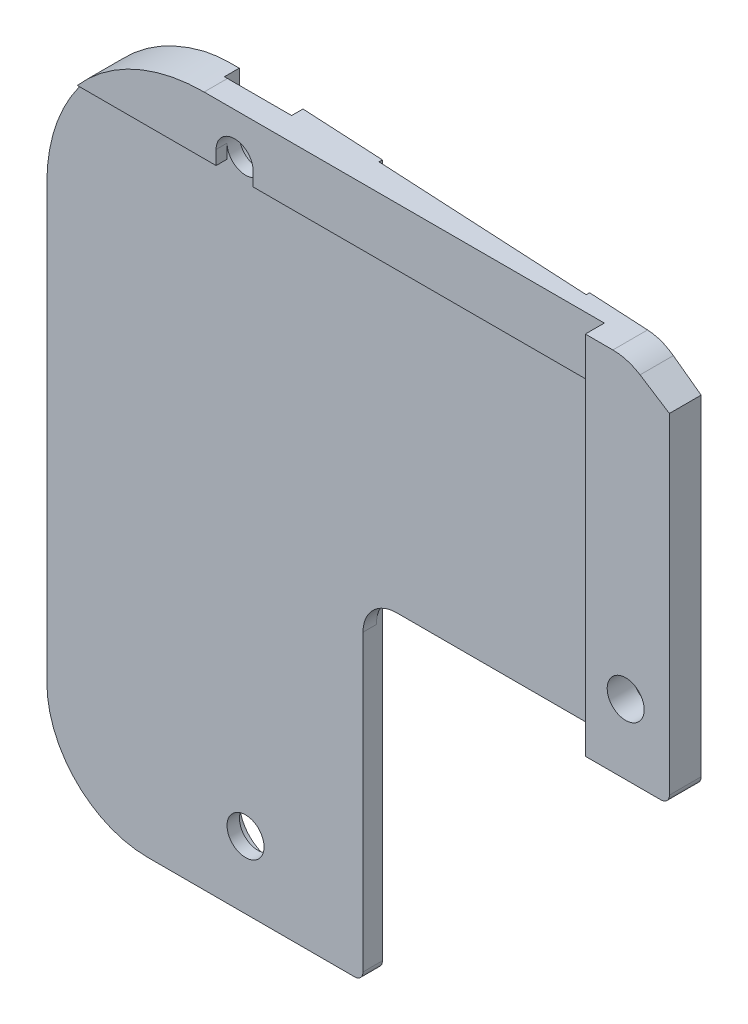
ISO-10303-21;
HEADER;
FILE_DESCRIPTION(('STEP AP214'),'2;1');
FILE_NAME('part.step','',(''),(''),'','','');
FILE_SCHEMA(('AUTOMOTIVE_DESIGN { 1 0 10303 214 1 1 1 1 }'));
ENDSEC;
DATA;
#1=APPLICATION_CONTEXT('core data for automotive mechanical design processes');
#2=APPLICATION_PROTOCOL_DEFINITION('international standard','automotive_design',2000,#1);
#3=PRODUCT_CONTEXT('',#1,'mechanical');
#4=PRODUCT('Part','Part','',(#3));
#5=PRODUCT_RELATED_PRODUCT_CATEGORY('part','',(#4));
#6=PRODUCT_DEFINITION_FORMATION('','',#4);
#7=PRODUCT_DEFINITION_CONTEXT('part definition',#1,'design');
#8=PRODUCT_DEFINITION('design','',#6,#7);
#9=PRODUCT_DEFINITION_SHAPE('','',#8);
#10=(LENGTH_UNIT() NAMED_UNIT(*) SI_UNIT(.MILLI.,.METRE.));
#11=(NAMED_UNIT(*) PLANE_ANGLE_UNIT() SI_UNIT($,.RADIAN.));
#12=(NAMED_UNIT(*) SI_UNIT($,.STERADIAN.) SOLID_ANGLE_UNIT());
#13=UNCERTAINTY_MEASURE_WITH_UNIT(LENGTH_MEASURE(1.E-05),#10,'distance_accuracy_value','');
#14=(GEOMETRIC_REPRESENTATION_CONTEXT(3) GLOBAL_UNCERTAINTY_ASSIGNED_CONTEXT((#13)) GLOBAL_UNIT_ASSIGNED_CONTEXT((#10,
#11,#12)) REPRESENTATION_CONTEXT('',''));
#15=CARTESIAN_POINT('',(0.,0.,0.));
#16=DIRECTION('',(0.,0.,1.));
#17=DIRECTION('',(1.,0.,0.));
#18=AXIS2_PLACEMENT_3D('',#15,#16,#17);
#19=CARTESIAN_POINT('',(36.4,-72.,-3.18));
#20=DIRECTION('',(0.,0.,-1.));
#21=DIRECTION('',(-1.,0.,0.));
#22=AXIS2_PLACEMENT_3D('',#19,#20,#21);
#23=CYLINDRICAL_SURFACE('',#22,1.10000000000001);
#24=CARTESIAN_POINT('',(36.4,-72.,-3.18));
#25=DIRECTION('',(0.,0.,-1.));
#26=DIRECTION('',(-1.,0.,0.));
#27=AXIS2_PLACEMENT_3D('',#24,#25,#26);
#28=CIRCLE('',#27,1.10000000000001);
#29=CARTESIAN_POINT('',(35.3,-72.,-3.18));
#30=VERTEX_POINT('',#29);
#31=EDGE_CURVE('E282',#30,#30,#28,.T.);
#32=ORIENTED_EDGE('',*,*,#31,.F.);
#33=EDGE_LOOP('',(#32));
#34=FACE_BOUND('',#33,.T.);
#35=CARTESIAN_POINT('',(36.4,-72.,-4.7));
#36=DIRECTION('',(0.,0.,-1.));
#37=DIRECTION('',(-1.,0.,0.));
#38=AXIS2_PLACEMENT_3D('',#35,#36,#37);
#39=CIRCLE('',#38,1.10000000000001);
#40=CARTESIAN_POINT('',(35.3,-72.,-4.7));
#41=VERTEX_POINT('',#40);
#42=EDGE_CURVE('E732',#41,#41,#39,.F.);
#43=ORIENTED_EDGE('',*,*,#42,.F.);
#44=EDGE_LOOP('',(#43));
#45=FACE_BOUND('',#44,.T.);
#46=ADVANCED_FACE('F39',(#34,#45),#23,.F.);
#47=CARTESIAN_POINT('',(12.015,-57.,-3.18));
#48=DIRECTION('',(0.,0.,-1.));
#49=DIRECTION('',(-1.,0.,0.));
#50=AXIS2_PLACEMENT_3D('',#47,#48,#49);
#51=CYLINDRICAL_SURFACE('',#50,1.1);
#52=CARTESIAN_POINT('',(12.015,-57.,-5.7));
#53=DIRECTION('',(0.,0.,-1.));
#54=DIRECTION('',(-1.,0.,0.));
#55=AXIS2_PLACEMENT_3D('',#52,#53,#54);
#56=CIRCLE('',#55,1.1);
#57=CARTESIAN_POINT('',(10.915,-57.,-5.7));
#58=VERTEX_POINT('',#57);
#59=EDGE_CURVE('E274',#58,#58,#56,.T.);
#60=ORIENTED_EDGE('',*,*,#59,.T.);
#61=EDGE_LOOP('',(#60));
#62=FACE_BOUND('',#61,.T.);
#63=CARTESIAN_POINT('',(12.015,-57.,-4.96));
#64=DIRECTION('',(0.,0.,1.));
#65=DIRECTION('',(1.,0.,0.));
#66=AXIS2_PLACEMENT_3D('',#63,#64,#65);
#67=CIRCLE('',#66,1.1);
#68=CARTESIAN_POINT('',(10.915,-57.,-4.96));
#69=VERTEX_POINT('',#68);
#70=CARTESIAN_POINT('',(13.115,-57.,-4.96));
#71=VERTEX_POINT('',#70);
#72=EDGE_CURVE('E273',#69,#71,#67,.T.);
#73=ORIENTED_EDGE('',*,*,#72,.T.);
#74=DIRECTION('',(0.,0.,1.));
#75=VECTOR('',#74,1.);
#76=CARTESIAN_POINT('',(13.115,-57.,-7.88775103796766));
#77=LINE('',#76,#75);
#78=CARTESIAN_POINT('',(13.115,-57.,-4.31));
#79=VERTEX_POINT('',#78);
#80=EDGE_CURVE('E272',#71,#79,#77,.T.);
#81=ORIENTED_EDGE('',*,*,#80,.T.);
#82=CARTESIAN_POINT('',(12.015,-57.,-4.31));
#83=DIRECTION('',(0.,0.,1.));
#84=DIRECTION('',(1.,0.,0.));
#85=AXIS2_PLACEMENT_3D('',#82,#83,#84);
#86=CIRCLE('',#85,1.1);
#87=CARTESIAN_POINT('',(10.915,-57.,-4.31));
#88=VERTEX_POINT('',#87);
#89=EDGE_CURVE('E263',#79,#88,#86,.T.);
#90=ORIENTED_EDGE('',*,*,#89,.T.);
#91=DIRECTION('',(0.,0.,1.));
#92=VECTOR('',#91,1.);
#93=CARTESIAN_POINT('',(10.915,-57.,-7.88775103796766));
#94=LINE('',#93,#92);
#95=EDGE_CURVE('E246',#69,#88,#94,.T.);
#96=ORIENTED_EDGE('',*,*,#95,.F.);
#97=EDGE_LOOP('',(#73,#81,#90,#96));
#98=FACE_BOUND('',#97,.T.);
#99=ADVANCED_FACE('F270',(#62,#98),#51,.F.);
#100=CARTESIAN_POINT('',(0.,-57.8317676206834,-4.31));
#101=DIRECTION('',(0.,1.,0.));
#102=DIRECTION('',(0.,0.,1.));
#103=AXIS2_PLACEMENT_3D('',#100,#101,#102);
#104=PLANE('',#103);
#105=DIRECTION('',(1.,0.,0.));
#106=VECTOR('',#105,1.);
#107=CARTESIAN_POINT('',(0.,-57.8317676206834,-4.96));
#108=LINE('',#107,#106);
#109=CARTESIAN_POINT('',(13.115,-57.8317676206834,-4.96));
#110=VERTEX_POINT('',#109);
#111=CARTESIAN_POINT('',(33.,-57.8317676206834,-4.96));
#112=VERTEX_POINT('',#111);
#113=EDGE_CURVE('E401',#110,#112,#108,.T.);
#114=ORIENTED_EDGE('',*,*,#113,.T.);
#115=DIRECTION('',(0.,0.,-1.));
#116=VECTOR('',#115,1.);
#117=CARTESIAN_POINT('',(33.,-57.8317676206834,-4.31000000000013));
#118=LINE('',#117,#116);
#119=CARTESIAN_POINT('',(33.,-57.8317676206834,-4.31));
#120=VERTEX_POINT('',#119);
#121=EDGE_CURVE('E47',#112,#120,#118,.F.);
#122=ORIENTED_EDGE('',*,*,#121,.T.);
#123=DIRECTION('',(1.,0.,0.));
#124=VECTOR('',#123,1.);
#125=CARTESIAN_POINT('',(0.,-57.8317676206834,-4.31));
#126=LINE('',#125,#124);
#127=CARTESIAN_POINT('',(13.115,-57.8317676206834,-4.31));
#128=VERTEX_POINT('',#127);
#129=EDGE_CURVE('E404',#128,#120,#126,.T.);
#130=ORIENTED_EDGE('',*,*,#129,.F.);
#131=DIRECTION('',(0.,0.,1.));
#132=VECTOR('',#131,1.);
#133=CARTESIAN_POINT('',(13.115,-57.8317676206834,-7.88775103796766));
#134=LINE('',#133,#132);
#135=EDGE_CURVE('E1014',#110,#128,#134,.T.);
#136=ORIENTED_EDGE('',*,*,#135,.F.);
#137=EDGE_LOOP('',(#114,#122,#130,#136));
#138=FACE_BOUND('',#137,.T.);
#139=ADVANCED_FACE('F473',(#138),#104,.F.);
#140=CARTESIAN_POINT('',(34.,-138.758529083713,-4.96));
#141=DIRECTION('',(-1.,0.,0.));
#142=DIRECTION('',(0.,0.,1.));
#143=AXIS2_PLACEMENT_3D('',#140,#141,#142);
#144=PLANE('',#143);
#145=DIRECTION('',(0.,1.,0.));
#146=VECTOR('',#145,1.);
#147=CARTESIAN_POINT('',(34.,-52.2,-4.31));
#148=LINE('',#147,#146);
#149=CARTESIAN_POINT('',(34.,-58.8317676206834,-4.31));
#150=VERTEX_POINT('',#149);
#151=CARTESIAN_POINT('',(34.,-54.4,-4.31));
#152=VERTEX_POINT('',#151);
#153=EDGE_CURVE('E403',#150,#152,#148,.T.);
#154=ORIENTED_EDGE('',*,*,#153,.F.);
#155=DIRECTION('',(0.,0.,-1.));
#156=VECTOR('',#155,1.);
#157=CARTESIAN_POINT('',(34.,-58.8317676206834,-4.96));
#158=LINE('',#157,#156);
#159=CARTESIAN_POINT('',(34.,-58.8317676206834,-4.96));
#160=VERTEX_POINT('',#159);
#161=EDGE_CURVE('E692',#150,#160,#158,.T.);
#162=ORIENTED_EDGE('',*,*,#161,.T.);
#163=DIRECTION('',(0.,1.,0.));
#164=VECTOR('',#163,1.);
#165=CARTESIAN_POINT('',(34.,-138.758529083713,-4.96));
#166=LINE('',#165,#164);
#167=CARTESIAN_POINT('',(34.,-76.145,-4.96));
#168=VERTEX_POINT('',#167);
#169=EDGE_CURVE('E407',#168,#160,#166,.T.);
#170=ORIENTED_EDGE('',*,*,#169,.F.);
#171=DIRECTION('',(0.,0.,1.));
#172=VECTOR('',#171,1.);
#173=CARTESIAN_POINT('',(34.,-76.145,-4.96));
#174=LINE('',#173,#172);
#175=CARTESIAN_POINT('',(34.,-76.145,-3.18));
#176=VERTEX_POINT('',#175);
#177=EDGE_CURVE('E373',#168,#176,#174,.T.);
#178=ORIENTED_EDGE('',*,*,#177,.T.);
#179=DIRECTION('',(0.,1.,0.));
#180=VECTOR('',#179,1.);
#181=CARTESIAN_POINT('',(34.,-138.758529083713,-3.18));
#182=LINE('',#181,#180);
#183=CARTESIAN_POINT('',(34.,-54.4,-3.18));
#184=VERTEX_POINT('',#183);
#185=EDGE_CURVE('E701',#176,#184,#182,.T.);
#186=ORIENTED_EDGE('',*,*,#185,.T.);
#187=DIRECTION('',(0.,0.,-1.));
#188=VECTOR('',#187,1.);
#189=CARTESIAN_POINT('',(34.,-54.4,-4.96));
#190=LINE('',#189,#188);
#191=EDGE_CURVE('E327',#184,#152,#190,.T.);
#192=ORIENTED_EDGE('',*,*,#191,.T.);
#193=EDGE_LOOP('',(#154,#162,#170,#178,#186,#192));
#194=FACE_BOUND('',#193,.T.);
#195=ADVANCED_FACE('F469',(#194),#144,.T.);
#196=CARTESIAN_POINT('',(0.,-138.758529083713,-4.96));
#197=DIRECTION('',(0.,0.,1.));
#198=DIRECTION('',(1.,0.,0.));
#199=AXIS2_PLACEMENT_3D('',#196,#197,#198);
#200=PLANE('',#199);
#201=ORIENTED_EDGE('',*,*,#169,.T.);
#202=CARTESIAN_POINT('',(33.,-58.8317676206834,-4.96));
#203=DIRECTION('',(0.,0.,1.));
#204=DIRECTION('',(1.,0.,0.));
#205=AXIS2_PLACEMENT_3D('',#202,#203,#204);
#206=CIRCLE('',#205,1.);
#207=EDGE_CURVE('E61',#160,#112,#206,.T.);
#208=ORIENTED_EDGE('',*,*,#207,.T.);
#209=ORIENTED_EDGE('',*,*,#113,.F.);
#210=DIRECTION('',(0.,-1.,0.));
#211=VECTOR('',#210,1.);
#212=CARTESIAN_POINT('',(13.115,-57.8317676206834,-4.96));
#213=LINE('',#212,#211);
#214=EDGE_CURVE('E1010',#71,#110,#213,.T.);
#215=ORIENTED_EDGE('',*,*,#214,.F.);
#216=ORIENTED_EDGE('',*,*,#72,.F.);
#217=DIRECTION('',(0.,1.,0.));
#218=VECTOR('',#217,1.);
#219=CARTESIAN_POINT('',(10.915,-57.,-4.96));
#220=LINE('',#219,#218);
#221=CARTESIAN_POINT('',(10.915,-57.8317676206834,-4.96));
#222=VERTEX_POINT('',#221);
#223=EDGE_CURVE('E252',#222,#69,#220,.T.);
#224=ORIENTED_EDGE('',*,*,#223,.F.);
#225=CARTESIAN_POINT('',(2.65955416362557,-57.8317676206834,-4.96));
#226=VERTEX_POINT('',#225);
#227=EDGE_CURVE('E408',#226,#222,#108,.T.);
#228=ORIENTED_EDGE('',*,*,#227,.F.);
#229=CARTESIAN_POINT('',(10.2,-64.4,-4.96));
#230=DIRECTION('',(0.,0.,1.));
#231=DIRECTION('',(1.,0.,0.));
#232=AXIS2_PLACEMENT_3D('',#229,#230,#231);
#233=CIRCLE('',#232,10.);
#234=CARTESIAN_POINT('',(0.199999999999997,-64.4,-4.96));
#235=VERTEX_POINT('',#234);
#236=EDGE_CURVE('E367',#226,#235,#233,.T.);
#237=ORIENTED_EDGE('',*,*,#236,.T.);
#238=DIRECTION('',(0.,-1.,0.));
#239=VECTOR('',#238,1.);
#240=CARTESIAN_POINT('',(0.20000000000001,-138.758529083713,-4.96));
#241=LINE('',#240,#239);
#242=CARTESIAN_POINT('',(0.199999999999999,-90.145,-4.96));
#243=VERTEX_POINT('',#242);
#244=EDGE_CURVE('E395',#235,#243,#241,.T.);
#245=ORIENTED_EDGE('',*,*,#244,.T.);
#246=CARTESIAN_POINT('',(6.2,-90.145,-4.96));
#247=DIRECTION('',(0.,0.,1.));
#248=DIRECTION('',(1.,0.,0.));
#249=AXIS2_PLACEMENT_3D('',#246,#247,#248);
#250=CIRCLE('',#249,6.);
#251=CARTESIAN_POINT('',(6.2,-96.145,-4.96));
#252=VERTEX_POINT('',#251);
#253=EDGE_CURVE('E398',#243,#252,#250,.T.);
#254=ORIENTED_EDGE('',*,*,#253,.T.);
#255=DIRECTION('',(1.,0.,0.));
#256=VECTOR('',#255,1.);
#257=CARTESIAN_POINT('',(0.,-96.145,-4.96));
#258=LINE('',#257,#256);
#259=CARTESIAN_POINT('',(18.5,-96.145,-4.96));
#260=VERTEX_POINT('',#259);
#261=EDGE_CURVE('E392',#252,#260,#258,.T.);
#262=ORIENTED_EDGE('',*,*,#261,.T.);
#263=CARTESIAN_POINT('',(18.5,-95.645,-4.96));
#264=DIRECTION('',(0.,0.,1.));
#265=DIRECTION('',(1.,0.,0.));
#266=AXIS2_PLACEMENT_3D('',#263,#264,#265);
#267=CIRCLE('',#266,0.5);
#268=CARTESIAN_POINT('',(19.,-95.645,-4.96));
#269=VERTEX_POINT('',#268);
#270=EDGE_CURVE('E683',#260,#269,#267,.T.);
#271=ORIENTED_EDGE('',*,*,#270,.T.);
#272=DIRECTION('',(0.,1.,0.));
#273=VECTOR('',#272,1.);
#274=CARTESIAN_POINT('',(19.,-138.758529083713,-4.96));
#275=LINE('',#274,#273);
#276=CARTESIAN_POINT('',(19.,-78.145,-4.96));
#277=VERTEX_POINT('',#276);
#278=EDGE_CURVE('E388',#269,#277,#275,.T.);
#279=ORIENTED_EDGE('',*,*,#278,.T.);
#280=CARTESIAN_POINT('',(21.,-78.145,-4.96));
#281=DIRECTION('',(0.,0.,1.));
#282=DIRECTION('',(1.,0.,0.));
#283=AXIS2_PLACEMENT_3D('',#280,#281,#282);
#284=CIRCLE('',#283,2.);
#285=CARTESIAN_POINT('',(21.,-76.145,-4.96));
#286=VERTEX_POINT('',#285);
#287=EDGE_CURVE('E425',#277,#286,#284,.F.);
#288=ORIENTED_EDGE('',*,*,#287,.T.);
#289=DIRECTION('',(1.,0.,0.));
#290=VECTOR('',#289,1.);
#291=CARTESIAN_POINT('',(0.,-76.145,-4.96));
#292=LINE('',#291,#290);
#293=EDGE_CURVE('E376',#286,#168,#292,.T.);
#294=ORIENTED_EDGE('',*,*,#293,.T.);
#295=EDGE_LOOP('',(#201,#208,#209,#215,#216,#224,#228,#237,#245,#254,#262,#271,#279,#288,#294));
#296=FACE_BOUND('',#295,.T.);
#297=CARTESIAN_POINT('',(12.015,-92.145,-4.96));
#298=DIRECTION('',(0.,0.,1.));
#299=DIRECTION('',(1.,0.,0.));
#300=AXIS2_PLACEMENT_3D('',#297,#298,#299);
#301=CIRCLE('',#300,1.1);
#302=CARTESIAN_POINT('',(13.115,-92.145,-4.96));
#303=VERTEX_POINT('',#302);
#304=EDGE_CURVE('E276',#303,#303,#301,.T.);
#305=ORIENTED_EDGE('',*,*,#304,.F.);
#306=EDGE_LOOP('',(#305));
#307=FACE_BOUND('',#306,.T.);
#308=ADVANCED_FACE('F472',(#296,#307),#200,.T.);
#309=CARTESIAN_POINT('',(0.,-138.758529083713,-6.7));
#310=DIRECTION('',(0.,0.,-1.));
#311=DIRECTION('',(-1.,0.,0.));
#312=AXIS2_PLACEMENT_3D('',#309,#310,#311);
#313=PLANE('',#312);
#314=DIRECTION('',(0.,-1.,0.));
#315=VECTOR('',#314,1.);
#316=CARTESIAN_POINT('',(0.200000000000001,-90.145,-6.7));
#317=LINE('',#316,#315);
#318=CARTESIAN_POINT('',(0.199999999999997,-64.4,-6.7));
#319=VERTEX_POINT('',#318);
#320=CARTESIAN_POINT('',(0.200000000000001,-90.145,-6.7));
#321=VERTEX_POINT('',#320);
#322=EDGE_CURVE('E315',#319,#321,#317,.T.);
#323=ORIENTED_EDGE('',*,*,#322,.F.);
#324=CARTESIAN_POINT('',(10.2,-64.4,-6.7));
#325=DIRECTION('',(0.,0.,1.));
#326=DIRECTION('',(1.,0.,0.));
#327=AXIS2_PLACEMENT_3D('',#324,#325,#326);
#328=CIRCLE('',#327,10.);
#329=CARTESIAN_POINT('',(7.83491967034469,-54.6837046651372,-6.7));
#330=VERTEX_POINT('',#329);
#331=EDGE_CURVE('E313',#330,#319,#328,.T.);
#332=ORIENTED_EDGE('',*,*,#331,.F.);
#333=DIRECTION('',(0.,1.,0.));
#334=VECTOR('',#333,1.);
#335=CARTESIAN_POINT('',(7.8349196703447,-138.758529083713,-6.7));
#336=LINE('',#335,#334);
#337=CARTESIAN_POINT('',(7.83491967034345,-96.145,-6.70000000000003));
#338=VERTEX_POINT('',#337);
#339=EDGE_CURVE('E411',#338,#330,#336,.T.);
#340=ORIENTED_EDGE('',*,*,#339,.F.);
#341=DIRECTION('',(1.,0.,0.));
#342=VECTOR('',#341,1.);
#343=CARTESIAN_POINT('',(6.2,-96.145,-6.7));
#344=LINE('',#343,#342);
#345=CARTESIAN_POINT('',(6.2,-96.145,-6.7));
#346=VERTEX_POINT('',#345);
#347=EDGE_CURVE('E321',#346,#338,#344,.T.);
#348=ORIENTED_EDGE('',*,*,#347,.F.);
#349=CARTESIAN_POINT('',(6.2,-90.145,-6.7));
#350=DIRECTION('',(0.,0.,1.));
#351=DIRECTION('',(-1.,0.,0.));
#352=AXIS2_PLACEMENT_3D('',#349,#350,#351);
#353=CIRCLE('',#352,6.);
#354=EDGE_CURVE('E318',#321,#346,#353,.T.);
#355=ORIENTED_EDGE('',*,*,#354,.F.);
#356=EDGE_LOOP('',(#323,#332,#340,#348,#355));
#357=FACE_BOUND('',#356,.T.);
#358=ADVANCED_FACE('F477',(#357),#313,.T.);
#359=CARTESIAN_POINT('',(19.,-138.758529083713,-6.11486293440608));
#360=DIRECTION('',(0.0523359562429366,0.,-0.998629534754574));
#361=DIRECTION('',(-0.998629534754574,0.,-0.0523359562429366));
#362=AXIS2_PLACEMENT_3D('',#359,#360,#361);
#363=PLANE('',#362);
#364=CARTESIAN_POINT('',(12.015,-92.145,-6.48093127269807));
#365=DIRECTION('',(0.0523359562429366,0.,-0.998629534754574));
#366=DIRECTION('',(-0.998629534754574,0.,-0.0523359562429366));
#367=AXIS2_PLACEMENT_3D('',#364,#365,#366);
#368=ELLIPSE('',#367,2.00274469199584,2.);
#369=CARTESIAN_POINT('',(10.015,-92.145,-6.58574683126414));
#370=VERTEX_POINT('',#369);
#371=EDGE_CURVE('E312',#370,#370,#368,.T.);
#372=ORIENTED_EDGE('',*,*,#371,.F.);
#373=EDGE_LOOP('',(#372));
#374=FACE_BOUND('',#373,.T.);
#375=DIRECTION('',(0.,1.,0.));
#376=VECTOR('',#375,1.);
#377=CARTESIAN_POINT('',(19.,-138.758529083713,-6.11486293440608));
#378=LINE('',#377,#376);
#379=CARTESIAN_POINT('',(19.,-95.645,-6.11486293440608));
#380=VERTEX_POINT('',#379);
#381=CARTESIAN_POINT('',(19.,-54.4,-6.11486293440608));
#382=VERTEX_POINT('',#381);
#383=EDGE_CURVE('E415',#380,#382,#378,.T.);
#384=ORIENTED_EDGE('',*,*,#383,.F.);
#385=CARTESIAN_POINT('',(18.5,-95.645,-6.1410668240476));
#386=DIRECTION('',(0.0523359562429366,0.,-0.998629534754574));
#387=DIRECTION('',(0.998629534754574,0.,0.0523359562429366));
#388=AXIS2_PLACEMENT_3D('',#385,#386,#387);
#389=ELLIPSE('',#388,0.50068617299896,0.5);
#390=CARTESIAN_POINT('',(18.5,-96.145,-6.1410668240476));
#391=VERTEX_POINT('',#390);
#392=EDGE_CURVE('E669',#380,#391,#389,.T.);
#393=ORIENTED_EDGE('',*,*,#392,.T.);
#394=DIRECTION('',(-0.998629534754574,0.,-0.0523359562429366));
#395=VECTOR('',#394,1.);
#396=CARTESIAN_POINT('',(19.,-96.145,-6.11486293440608));
#397=LINE('',#396,#395);
#398=EDGE_CURVE('E390',#391,#338,#397,.T.);
#399=ORIENTED_EDGE('',*,*,#398,.T.);
#400=ORIENTED_EDGE('',*,*,#339,.T.);
#401=CARTESIAN_POINT('',(10.2,-64.4,-6.57605139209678));
#402=DIRECTION('',(0.0523359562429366,0.,-0.998629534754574));
#403=DIRECTION('',(0.998629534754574,0.,0.0523359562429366));
#404=AXIS2_PLACEMENT_3D('',#401,#402,#403);
#405=ELLIPSE('',#404,10.0137234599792,10.);
#406=CARTESIAN_POINT('',(10.015,-54.4017113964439,-6.58574683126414));
#407=VERTEX_POINT('',#406);
#408=EDGE_CURVE('E370',#330,#407,#405,.T.);
#409=ORIENTED_EDGE('',*,*,#408,.T.);
#410=DIRECTION('',(0.,1.,0.));
#411=VECTOR('',#410,1.);
#412=CARTESIAN_POINT('',(10.015,-138.758529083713,-6.58574683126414));
#413=LINE('',#412,#411);
#414=CARTESIAN_POINT('',(10.015,-57.,-6.58574683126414));
#415=VERTEX_POINT('',#414);
#416=EDGE_CURVE('E310',#415,#407,#413,.T.);
#417=ORIENTED_EDGE('',*,*,#416,.F.);
#418=CARTESIAN_POINT('',(12.015,-57.,-6.48093127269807));
#419=DIRECTION('',(0.0523359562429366,0.,-0.998629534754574));
#420=DIRECTION('',(-0.998629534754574,0.,-0.0523359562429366));
#421=AXIS2_PLACEMENT_3D('',#418,#419,#420);
#422=ELLIPSE('',#421,2.00274469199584,2.);
#423=CARTESIAN_POINT('',(14.015,-57.,-6.37611571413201));
#424=VERTEX_POINT('',#423);
#425=EDGE_CURVE('E726',#424,#415,#422,.T.);
#426=ORIENTED_EDGE('',*,*,#425,.F.);
#427=DIRECTION('',(0.,-1.,0.));
#428=VECTOR('',#427,1.);
#429=CARTESIAN_POINT('',(14.015,-138.758529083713,-6.37611571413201));
#430=LINE('',#429,#428);
#431=CARTESIAN_POINT('',(14.015,-54.4,-6.37611571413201));
#432=VERTEX_POINT('',#431);
#433=EDGE_CURVE('E308',#432,#424,#430,.T.);
#434=ORIENTED_EDGE('',*,*,#433,.F.);
#435=DIRECTION('',(0.998629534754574,0.,0.0523359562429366));
#436=VECTOR('',#435,1.);
#437=CARTESIAN_POINT('',(19.,-54.4,-6.11486293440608));
#438=LINE('',#437,#436);
#439=EDGE_CURVE('E362',#432,#382,#438,.T.);
#440=ORIENTED_EDGE('',*,*,#439,.T.);
#441=EDGE_LOOP('',(#384,#393,#399,#400,#409,#417,#426,#434,#440));
#442=FACE_BOUND('',#441,.T.);
#443=ADVANCED_FACE('F657',(#374,#442),#363,.T.);
#444=CARTESIAN_POINT('',(19.,-138.758529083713,-6.11486293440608));
#445=DIRECTION('',(1.,0.,0.));
#446=DIRECTION('',(0.,0.,-1.));
#447=AXIS2_PLACEMENT_3D('',#444,#445,#446);
#448=PLANE('',#447);
#449=ORIENTED_EDGE('',*,*,#278,.F.);
#450=DIRECTION('',(0.,0.,1.));
#451=VECTOR('',#450,1.);
#452=CARTESIAN_POINT('',(19.,-95.645,-6.11486293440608));
#453=LINE('',#452,#451);
#454=EDGE_CURVE('E676',#269,#380,#453,.F.);
#455=ORIENTED_EDGE('',*,*,#454,.T.);
#456=ORIENTED_EDGE('',*,*,#383,.T.);
#457=DIRECTION('',(0.,0.,1.));
#458=VECTOR('',#457,1.);
#459=CARTESIAN_POINT('',(19.,-54.4,-6.11486293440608));
#460=LINE('',#459,#458);
#461=CARTESIAN_POINT('',(19.,-54.4,-5.9145884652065));
#462=VERTEX_POINT('',#461);
#463=EDGE_CURVE('E359',#382,#462,#460,.T.);
#464=ORIENTED_EDGE('',*,*,#463,.T.);
#465=DIRECTION('',(0.,1.,0.));
#466=VECTOR('',#465,1.);
#467=CARTESIAN_POINT('',(19.,-138.758529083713,-5.9145884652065));
#468=LINE('',#467,#466);
#469=CARTESIAN_POINT('',(19.,-76.2739600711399,-5.9145884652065));
#470=VERTEX_POINT('',#469);
#471=EDGE_CURVE('E417',#470,#462,#468,.T.);
#472=ORIENTED_EDGE('',*,*,#471,.F.);
#473=CARTESIAN_POINT('',(19.,-78.1450000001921,-5.75343244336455));
#474=CARTESIAN_POINT('',(19.0000017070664,-78.1188909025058,-5.75343222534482));
#475=CARTESIAN_POINT('',(19.0000035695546,-78.0927818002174,-5.75353385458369));
#476=CARTESIAN_POINT('',(19.0000057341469,-78.0405902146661,-5.75394079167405));
#477=CARTESIAN_POINT('',(19.0000060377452,-78.0145077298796,-5.7542459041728));
#478=CARTESIAN_POINT('',(19.0000032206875,-77.9622888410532,-5.75506068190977));
#479=CARTESIAN_POINT('',(19.0000000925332,-77.9361524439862,-5.75557079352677));
#480=CARTESIAN_POINT('',(18.9999999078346,-77.8839882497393,-5.75679027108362));
#481=CARTESIAN_POINT('',(19.0000028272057,-77.8579604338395,-5.75749883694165));
#482=CARTESIAN_POINT('',(19.0000055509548,-77.8058697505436,-5.75911818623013));
#483=CARTESIAN_POINT('',(19.0000053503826,-77.7798068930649,-5.76002928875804));
#484=CARTESIAN_POINT('',(19.0000026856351,-77.7275737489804,-5.76205566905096));
#485=CARTESIAN_POINT('',(19.0000002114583,-77.7014034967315,-5.76317183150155));
#486=CARTESIAN_POINT('',(18.9999997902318,-77.6492813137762,-5.76559232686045));
#487=CARTESIAN_POINT('',(19.0000018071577,-77.623329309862,-5.7668950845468));
#488=CARTESIAN_POINT('',(19.0000036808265,-77.5713316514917,-5.76970012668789));
#489=CARTESIAN_POINT('',(19.0000035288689,-77.5452860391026,-5.77120319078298));
#490=CARTESIAN_POINT('',(19.0000017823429,-77.4930425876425,-5.77441186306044));
#491=CARTESIAN_POINT('',(19.0000001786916,-77.4668448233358,-5.77611868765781));
#492=CARTESIAN_POINT('',(18.9999998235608,-77.414792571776,-5.7797002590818));
#493=CARTESIAN_POINT('',(19.0000010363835,-77.3889379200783,-5.78157261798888));
#494=CARTESIAN_POINT('',(19.0000021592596,-77.3370660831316,-5.78551386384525));
#495=CARTESIAN_POINT('',(19.000002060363,-77.3110489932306,-5.78758400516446));
#496=CARTESIAN_POINT('',(19.0000010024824,-77.258808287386,-5.79192416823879));
#497=CARTESIAN_POINT('',(19.0000000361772,-77.2325848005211,-5.79419574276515));
#498=CARTESIAN_POINT('',(18.9999999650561,-77.181047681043,-5.7988378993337));
#499=CARTESIAN_POINT('',(19.000000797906,-77.1557335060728,-5.80120246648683));
#500=CARTESIAN_POINT('',(19.000002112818,-77.1048872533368,-5.8061176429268));
#501=CARTESIAN_POINT('',(19.0000025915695,-77.0793553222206,-5.80866976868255));
#502=CARTESIAN_POINT('',(19.000002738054,-77.0280438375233,-5.81396307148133));
#503=CARTESIAN_POINT('',(19.0000023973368,-77.0022644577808,-5.81670593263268));
#504=CARTESIAN_POINT('',(19.0000016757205,-76.9504309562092,-5.82238360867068));
#505=CARTESIAN_POINT('',(19.0000012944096,-76.924377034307,-5.82532024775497));
#506=CARTESIAN_POINT('',(19.0000006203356,-76.8719694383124,-5.83138836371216));
#507=CARTESIAN_POINT('',(19.0000003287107,-76.8456159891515,-5.8345217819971));
#508=CARTESIAN_POINT('',(19.0000002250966,-76.7925863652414,-5.84098611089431));
#509=CARTESIAN_POINT('',(19.0000004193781,-76.7659104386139,-5.84431905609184));
#510=CARTESIAN_POINT('',(18.9999996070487,-76.7142586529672,-5.85092422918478));
#511=CARTESIAN_POINT('',(18.9999986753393,-76.6892815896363,-5.85418704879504));
#512=CARTESIAN_POINT('',(18.9999962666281,-76.6389958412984,-5.86088940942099));
#513=CARTESIAN_POINT('',(18.9999947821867,-76.6136874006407,-5.86433078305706));
#514=CARTESIAN_POINT('',(18.9999927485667,-76.5627247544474,-5.87139206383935));
#515=CARTESIAN_POINT('',(18.9999922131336,-76.5370708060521,-5.87501382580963));
#516=CARTESIAN_POINT('',(18.9999922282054,-76.4854043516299,-5.8824377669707));
#517=CARTESIAN_POINT('',(18.9999927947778,-76.4593921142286,-5.88624181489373));
#518=CARTESIAN_POINT('',(18.9999948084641,-76.4069978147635,-5.89403207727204));
#519=CARTESIAN_POINT('',(18.9999962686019,-76.3806160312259,-5.8980201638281));
#520=CARTESIAN_POINT('',(18.9999987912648,-76.3274728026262,-5.90618027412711));
#521=CARTESIAN_POINT('',(18.9999998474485,-76.3007116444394,-5.91035416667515));
#522=CARTESIAN_POINT('',(19.0000000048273,-76.2739600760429,-5.91458846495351));
#523=B_SPLINE_CURVE_WITH_KNOTS('',3,(#473,#474,#475,#476,#477,#478,#479,#480,#481,#482,#483,
#484,#485,#486,#487,#488,#489,#490,#491,#492,#493,#494,#495,#496,#497,#498,#499,#500,#501,#502,
#503,#504,#505,#506,#507,#508,#509,#510,#511,#512,#513,#514,#515,#516,#517,#518,#519,#520,#521,
#522),.UNSPECIFIED.,.F.,.F.,(4,2,2,2,2,2,2,2,2,2,2,2,2,2,2,2,2,2,2,2,2,2,2,2,4),(0.,
0.0783271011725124,0.156579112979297,0.235002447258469,0.313114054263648,0.391349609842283,
0.469930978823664,0.54788429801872,0.626150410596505,0.704909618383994,0.782676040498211,
0.860973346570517,0.939937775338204,1.01621034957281,1.09318731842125,1.17096146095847,
1.2496176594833,1.32923440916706,1.40988393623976,1.48545141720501,1.56207510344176,
1.63979980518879,1.7186662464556,1.79871050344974,1.87996428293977),.UNSPECIFIED.);
#524=CARTESIAN_POINT('',(19.,-78.145,-5.75343169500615));
#525=VERTEX_POINT('',#524);
#526=EDGE_CURVE('E504',#470,#525,#523,.F.);
#527=ORIENTED_EDGE('',*,*,#526,.T.);
#528=DIRECTION('',(0.,0.,1.));
#529=VECTOR('',#528,1.);
#530=CARTESIAN_POINT('',(19.,-78.145,-4.96));
#531=LINE('',#530,#529);
#532=EDGE_CURVE('E728',#525,#277,#531,.T.);
#533=ORIENTED_EDGE('',*,*,#532,.T.);
#534=EDGE_LOOP('',(#449,#455,#456,#464,#472,#527,#533));
#535=FACE_BOUND('',#534,.T.);
#536=ADVANCED_FACE('F450',(#535),#448,.T.);
#537=CARTESIAN_POINT('',(19.,-138.758529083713,-5.9145884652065));
#538=DIRECTION('',(0.0523359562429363,0.,-0.998629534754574));
#539=DIRECTION('',(-0.998629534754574,0.,-0.0523359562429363));
#540=AXIS2_PLACEMENT_3D('',#537,#538,#539);
#541=PLANE('',#540);
#542=DIRECTION('',(-0.998629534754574,0.,-0.0523359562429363));
#543=VECTOR('',#542,1.);
#544=CARTESIAN_POINT('',(19.,-75.3985898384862,-5.9145884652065));
#545=LINE('',#544,#543);
#546=CARTESIAN_POINT('',(32.,-75.3985898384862,-5.23328733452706));
#547=VERTEX_POINT('',#546);
#548=CARTESIAN_POINT('',(21.0104671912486,-75.3985898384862,-5.80922434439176));
#549=VERTEX_POINT('',#548);
#550=EDGE_CURVE('E437',#547,#549,#545,.T.);
#551=ORIENTED_EDGE('',*,*,#550,.T.);
#552=CARTESIAN_POINT('',(18.2725232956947,-78.3604808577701,-5.95271390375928));
#553=CARTESIAN_POINT('',(18.2577001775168,-78.172322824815,-5.95349075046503));
#554=CARTESIAN_POINT('',(18.2623719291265,-77.9826397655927,-5.95324591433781));
#555=CARTESIAN_POINT('',(18.2984056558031,-77.701831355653,-5.95135746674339));
#556=CARTESIAN_POINT('',(18.315246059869,-77.6088493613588,-5.95047489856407));
#557=CARTESIAN_POINT('',(18.358405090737,-77.4251103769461,-5.94821302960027));
#558=CARTESIAN_POINT('',(18.3847238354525,-77.3343544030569,-5.94683372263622));
#559=CARTESIAN_POINT('',(18.4465606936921,-77.1560318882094,-5.94359299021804));
#560=CARTESIAN_POINT('',(18.482078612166,-77.068465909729,-5.94173157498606));
#561=CARTESIAN_POINT('',(18.5619367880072,-76.8974530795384,-5.93754638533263));
#562=CARTESIAN_POINT('',(18.60627679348,-76.8140067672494,-5.93522262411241));
#563=CARTESIAN_POINT('',(18.7033084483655,-76.6521192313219,-5.9301374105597));
#564=CARTESIAN_POINT('',(18.7559997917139,-76.5736785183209,-5.92737597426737));
#565=CARTESIAN_POINT('',(18.869174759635,-76.4226350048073,-5.9214447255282));
#566=CARTESIAN_POINT('',(18.929658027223,-76.3500326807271,-5.91827493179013));
#567=CARTESIAN_POINT('',(19.0577747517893,-76.2114367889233,-5.91156061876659));
#568=CARTESIAN_POINT('',(19.1254078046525,-76.145443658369,-5.9080161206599));
#569=CARTESIAN_POINT('',(19.2671060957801,-76.0207668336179,-5.9005900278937));
#570=CARTESIAN_POINT('',(19.3411708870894,-75.9620835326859,-5.89670845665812));
#571=CARTESIAN_POINT('',(19.4949463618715,-75.8526494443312,-5.8886494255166));
#572=CARTESIAN_POINT('',(19.5746565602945,-75.8018990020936,-5.88447199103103));
#573=CARTESIAN_POINT('',(19.7388766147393,-75.7088694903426,-5.87586558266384));
#574=CARTESIAN_POINT('',(19.8233859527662,-75.6665907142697,-5.87143663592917));
#575=CARTESIAN_POINT('',(19.9963070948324,-75.5909534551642,-5.8623742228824));
#576=CARTESIAN_POINT('',(20.0847183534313,-75.557595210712,-5.85774078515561));
#577=CARTESIAN_POINT('',(20.2645047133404,-75.5001532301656,-5.8483185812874));
#578=CARTESIAN_POINT('',(20.3558787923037,-75.4760694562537,-5.8435298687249));
#579=CARTESIAN_POINT('',(20.632994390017,-75.4181148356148,-5.82900685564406));
#580=CARTESIAN_POINT('',(20.8217261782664,-75.3985751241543,-5.81911584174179));
#581=CARTESIAN_POINT('',(21.0104671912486,-75.3985898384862,-5.80922434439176));
#582=B_SPLINE_CURVE_WITH_KNOTS('',3,(#552,#553,#554,#555,#556,#557,#558,#559,#560,#561,#562,
#563,#564,#565,#566,#567,#568,#569,#570,#571,#572,#573,#574,#575,#576,#577,#578,#579,#580,#581),
.UNSPECIFIED.,.F.,.F.,(4,2,2,2,2,2,2,2,2,2,2,2,2,2,4),(-0.0785398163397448,0.127627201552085,
0.230710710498,0.333794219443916,0.436877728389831,0.539961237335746,0.643044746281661,
0.746128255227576,0.849211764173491,0.952295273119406,1.05537878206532,1.15846229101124,
1.26154579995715,1.36462930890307,1.5707963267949),.UNSPECIFIED.);
#583=EDGE_CURVE('E431',#549,#470,#582,.F.);
#584=ORIENTED_EDGE('',*,*,#583,.T.);
#585=ORIENTED_EDGE('',*,*,#471,.T.);
#586=DIRECTION('',(0.998629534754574,0.,0.0523359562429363));
#587=VECTOR('',#586,1.);
#588=CARTESIAN_POINT('',(19.,-54.4,-5.9145884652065));
#589=LINE('',#588,#587);
#590=CARTESIAN_POINT('',(32.,-54.4,-5.23328733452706));
#591=VERTEX_POINT('',#590);
#592=EDGE_CURVE('E356',#462,#591,#589,.T.);
#593=ORIENTED_EDGE('',*,*,#592,.T.);
#594=DIRECTION('',(0.,1.,0.));
#595=VECTOR('',#594,1.);
#596=CARTESIAN_POINT('',(32.,-138.758529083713,-5.23328733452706));
#597=LINE('',#596,#595);
#598=EDGE_CURVE('E420',#547,#591,#597,.T.);
#599=ORIENTED_EDGE('',*,*,#598,.F.);
#600=EDGE_LOOP('',(#551,#584,#585,#593,#599));
#601=FACE_BOUND('',#600,.T.);
#602=ADVANCED_FACE('F439',(#601),#541,.T.);
#603=CARTESIAN_POINT('',(32.,-138.758529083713,-5.23328733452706));
#604=DIRECTION('',(-1.,0.,0.));
#605=DIRECTION('',(0.,0.,1.));
#606=AXIS2_PLACEMENT_3D('',#603,#604,#605);
#607=PLANE('',#606);
#608=DIRECTION('',(0.,0.,1.));
#609=VECTOR('',#608,1.);
#610=CARTESIAN_POINT('',(32.,-76.145,-5.23328733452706));
#611=LINE('',#610,#609);
#612=CARTESIAN_POINT('',(32.,-76.145,-5.43356180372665));
#613=VERTEX_POINT('',#612);
#614=CARTESIAN_POINT('',(32.,-76.145,-5.03301286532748));
#615=VERTEX_POINT('',#614);
#616=EDGE_CURVE('E380',#613,#615,#611,.T.);
#617=ORIENTED_EDGE('',*,*,#616,.T.);
#618=DIRECTION('',(0.,-0.965836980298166,0.259150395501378));
#619=VECTOR('',#618,1.);
#620=CARTESIAN_POINT('',(32.,-75.2280621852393,-5.27904278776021));
#621=LINE('',#620,#619);
#622=EDGE_CURVE('E508',#615,#547,#621,.F.);
#623=ORIENTED_EDGE('',*,*,#622,.T.);
#624=ORIENTED_EDGE('',*,*,#598,.T.);
#625=DIRECTION('',(0.,0.,-1.));
#626=VECTOR('',#625,1.);
#627=CARTESIAN_POINT('',(32.,-54.4,-5.23328733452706));
#628=LINE('',#627,#626);
#629=CARTESIAN_POINT('',(32.,-54.4,-5.43356180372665));
#630=VERTEX_POINT('',#629);
#631=EDGE_CURVE('E353',#591,#630,#628,.T.);
#632=ORIENTED_EDGE('',*,*,#631,.T.);
#633=DIRECTION('',(0.,1.,0.));
#634=VECTOR('',#633,1.);
#635=CARTESIAN_POINT('',(32.,-138.758529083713,-5.43356180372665));
#636=LINE('',#635,#634);
#637=EDGE_CURVE('E1057',#613,#630,#636,.T.);
#638=ORIENTED_EDGE('',*,*,#637,.F.);
#639=EDGE_LOOP('',(#617,#623,#624,#632,#638));
#640=FACE_BOUND('',#639,.T.);
#641=ADVANCED_FACE('F449',(#640),#607,.T.);
#642=CARTESIAN_POINT('',(32.,-138.758529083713,-5.43356180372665));
#643=DIRECTION('',(0.0523359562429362,0.,-0.998629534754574));
#644=DIRECTION('',(-0.998629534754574,0.,-0.0523359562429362));
#645=AXIS2_PLACEMENT_3D('',#642,#643,#644);
#646=PLANE('',#645);
#647=CARTESIAN_POINT('',(36.4,-72.,-5.2029675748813));
#648=DIRECTION('',(0.0523359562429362,0.,-0.998629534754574));
#649=DIRECTION('',(-0.998629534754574,0.,-0.0523359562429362));
#650=AXIS2_PLACEMENT_3D('',#647,#648,#649);
#651=ELLIPSE('',#650,2.00274469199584,2.);
#652=CARTESIAN_POINT('',(34.4,-72.,-5.30778313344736));
#653=VERTEX_POINT('',#652);
#654=EDGE_CURVE('E267',#653,#653,#651,.T.);
#655=ORIENTED_EDGE('',*,*,#654,.F.);
#656=EDGE_LOOP('',(#655));
#657=FACE_BOUND('',#656,.T.);
#658=DIRECTION('',(0.,1.,0.));
#659=VECTOR('',#658,1.);
#660=CARTESIAN_POINT('',(39.,-138.758529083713,-5.06670734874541));
#661=LINE('',#660,#659);
#662=CARTESIAN_POINT('',(39.,-75.645,-5.06670734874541));
#663=VERTEX_POINT('',#662);
#664=CARTESIAN_POINT('',(39.,-55.989269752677,-5.06670734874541));
#665=VERTEX_POINT('',#664);
#666=EDGE_CURVE('E1065',#663,#665,#661,.T.);
#667=ORIENTED_EDGE('',*,*,#666,.F.);
#668=CARTESIAN_POINT('',(38.5,-75.645,-5.09291123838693));
#669=DIRECTION('',(0.0523359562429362,0.,-0.998629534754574));
#670=DIRECTION('',(0.998629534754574,0.,0.0523359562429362));
#671=AXIS2_PLACEMENT_3D('',#668,#669,#670);
#672=ELLIPSE('',#671,0.50068617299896,0.5);
#673=CARTESIAN_POINT('',(38.5,-76.145,-5.09291123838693));
#674=VERTEX_POINT('',#673);
#675=EDGE_CURVE('E690',#663,#674,#672,.T.);
#676=ORIENTED_EDGE('',*,*,#675,.T.);
#677=DIRECTION('',(-0.998629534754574,0.,-0.0523359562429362));
#678=VECTOR('',#677,1.);
#679=CARTESIAN_POINT('',(32.,-76.145,-5.43356180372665));
#680=LINE('',#679,#678);
#681=EDGE_CURVE('E378',#674,#613,#680,.T.);
#682=ORIENTED_EDGE('',*,*,#681,.T.);
#683=ORIENTED_EDGE('',*,*,#637,.T.);
#684=DIRECTION('',(0.998629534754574,0.,0.0523359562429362));
#685=VECTOR('',#684,1.);
#686=CARTESIAN_POINT('',(32.,-54.4,-5.43356180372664));
#687=LINE('',#686,#685);
#688=CARTESIAN_POINT('',(35.6390282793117,-54.4,-5.24284841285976));
#689=VERTEX_POINT('',#688);
#690=EDGE_CURVE('E350',#630,#689,#687,.T.);
#691=ORIENTED_EDGE('',*,*,#690,.T.);
#692=CARTESIAN_POINT('',(35.6390282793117,-57.4,-5.24284841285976));
#693=DIRECTION('',(0.0523359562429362,0.,-0.998629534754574));
#694=DIRECTION('',(0.998629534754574,0.,0.0523359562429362));
#695=AXIS2_PLACEMENT_3D('',#692,#693,#694);
#696=ELLIPSE('',#695,3.00411703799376,3.);
#697=CARTESIAN_POINT('',(37.2562357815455,-54.8732155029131,-5.15809415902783));
#698=VERTEX_POINT('',#697);
#699=EDGE_CURVE('E385',#689,#698,#696,.T.);
#700=ORIENTED_EDGE('',*,*,#699,.T.);
#701=DIRECTION('',(0.84144215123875,-0.538544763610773,0.0440981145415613));
#702=VECTOR('',#701,1.);
#703=CARTESIAN_POINT('',(71.5374560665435,-76.8140841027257,-3.3614915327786));
#704=LINE('',#703,#702);
#705=EDGE_CURVE('E382',#698,#665,#704,.T.);
#706=ORIENTED_EDGE('',*,*,#705,.T.);
#707=EDGE_LOOP('',(#667,#676,#682,#683,#691,#700,#706));
#708=FACE_BOUND('',#707,.T.);
#709=ADVANCED_FACE('F455',(#657,#708),#646,.T.);
#710=CARTESIAN_POINT('',(39.,-138.758529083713,-3.18));
#711=DIRECTION('',(1.,0.,0.));
#712=DIRECTION('',(0.,0.,-1.));
#713=AXIS2_PLACEMENT_3D('',#710,#711,#712);
#714=PLANE('',#713);
#715=DIRECTION('',(0.,1.,0.));
#716=VECTOR('',#715,1.);
#717=CARTESIAN_POINT('',(39.,-138.758529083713,-3.18));
#718=LINE('',#717,#716);
#719=CARTESIAN_POINT('',(39.,-75.645,-3.18));
#720=VERTEX_POINT('',#719);
#721=CARTESIAN_POINT('',(39.,-55.989269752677,-3.18));
#722=VERTEX_POINT('',#721);
#723=EDGE_CURVE('E704',#720,#722,#718,.T.);
#724=ORIENTED_EDGE('',*,*,#723,.F.);
#725=DIRECTION('',(0.,0.,1.));
#726=VECTOR('',#725,1.);
#727=CARTESIAN_POINT('',(39.,-75.645,-3.18));
#728=LINE('',#727,#726);
#729=EDGE_CURVE('E688',#720,#663,#728,.F.);
#730=ORIENTED_EDGE('',*,*,#729,.T.);
#731=ORIENTED_EDGE('',*,*,#666,.T.);
#732=DIRECTION('',(0.,0.,1.));
#733=VECTOR('',#732,1.);
#734=CARTESIAN_POINT('',(39.,-55.989269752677,-6.7));
#735=LINE('',#734,#733);
#736=EDGE_CURVE('E334',#665,#722,#735,.T.);
#737=ORIENTED_EDGE('',*,*,#736,.T.);
#738=EDGE_LOOP('',(#724,#730,#731,#737));
#739=FACE_BOUND('',#738,.T.);
#740=ADVANCED_FACE('F459',(#739),#714,.T.);
#741=CARTESIAN_POINT('',(34.,-138.758529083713,-3.18));
#742=DIRECTION('',(0.,0.,1.));
#743=DIRECTION('',(1.,0.,0.));
#744=AXIS2_PLACEMENT_3D('',#741,#742,#743);
#745=PLANE('',#744);
#746=ORIENTED_EDGE('',*,*,#31,.T.);
#747=EDGE_LOOP('',(#746));
#748=FACE_BOUND('',#747,.T.);
#749=DIRECTION('',(1.,0.,0.));
#750=VECTOR('',#749,1.);
#751=CARTESIAN_POINT('',(34.,-76.145,-3.18));
#752=LINE('',#751,#750);
#753=CARTESIAN_POINT('',(38.5,-76.145,-3.18));
#754=VERTEX_POINT('',#753);
#755=EDGE_CURVE('E712',#176,#754,#752,.T.);
#756=ORIENTED_EDGE('',*,*,#755,.T.);
#757=CARTESIAN_POINT('',(38.5,-75.645,-3.18));
#758=DIRECTION('',(0.,0.,1.));
#759=DIRECTION('',(1.,0.,0.));
#760=AXIS2_PLACEMENT_3D('',#757,#758,#759);
#761=CIRCLE('',#760,0.5);
#762=EDGE_CURVE('E681',#754,#720,#761,.T.);
#763=ORIENTED_EDGE('',*,*,#762,.T.);
#764=ORIENTED_EDGE('',*,*,#723,.T.);
#765=DIRECTION('',(-0.842261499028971,0.539069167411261,0.));
#766=VECTOR('',#765,1.);
#767=CARTESIAN_POINT('',(73.0333010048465,-77.7714635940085,-3.18));
#768=LINE('',#767,#766);
#769=CARTESIAN_POINT('',(37.2562357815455,-54.8732155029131,-3.18));
#770=VERTEX_POINT('',#769);
#771=EDGE_CURVE('E715',#722,#770,#768,.T.);
#772=ORIENTED_EDGE('',*,*,#771,.T.);
#773=CARTESIAN_POINT('',(35.6390282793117,-57.4,-3.18));
#774=DIRECTION('',(0.,0.,1.));
#775=DIRECTION('',(1.,0.,0.));
#776=AXIS2_PLACEMENT_3D('',#773,#774,#775);
#777=CIRCLE('',#776,3.);
#778=CARTESIAN_POINT('',(35.6390282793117,-54.4,-3.18));
#779=VERTEX_POINT('',#778);
#780=EDGE_CURVE('E718',#770,#779,#777,.T.);
#781=ORIENTED_EDGE('',*,*,#780,.T.);
#782=DIRECTION('',(-1.,0.,0.));
#783=VECTOR('',#782,1.);
#784=CARTESIAN_POINT('',(34.,-54.4,-3.18));
#785=LINE('',#784,#783);
#786=EDGE_CURVE('E347',#779,#184,#785,.T.);
#787=ORIENTED_EDGE('',*,*,#786,.T.);
#788=ORIENTED_EDGE('',*,*,#185,.F.);
#789=EDGE_LOOP('',(#756,#763,#764,#772,#781,#787,#788));
#790=FACE_BOUND('',#789,.T.);
#791=ADVANCED_FACE('F463',(#748,#790),#745,.T.);
#792=ORIENTED_EDGE('',*,*,#227,.T.);
#793=DIRECTION('',(0.,0.,1.));
#794=VECTOR('',#793,1.);
#795=CARTESIAN_POINT('',(10.915,-57.8317676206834,-7.88775103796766));
#796=LINE('',#795,#794);
#797=CARTESIAN_POINT('',(10.915,-57.8317676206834,-4.31));
#798=VERTEX_POINT('',#797);
#799=EDGE_CURVE('E255',#222,#798,#796,.T.);
#800=ORIENTED_EDGE('',*,*,#799,.T.);
#801=CARTESIAN_POINT('',(2.65955416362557,-57.8317676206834,-4.31));
#802=VERTEX_POINT('',#801);
#803=EDGE_CURVE('E266',#802,#798,#126,.T.);
#804=ORIENTED_EDGE('',*,*,#803,.F.);
#805=DIRECTION('',(0.,0.,1.));
#806=VECTOR('',#805,1.);
#807=CARTESIAN_POINT('',(2.65955416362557,-57.8317676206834,-6.7));
#808=LINE('',#807,#806);
#809=EDGE_CURVE('E365',#226,#802,#808,.T.);
#810=ORIENTED_EDGE('',*,*,#809,.F.);
#811=EDGE_LOOP('',(#792,#800,#804,#810));
#812=FACE_BOUND('',#811,.T.);
#813=ADVANCED_FACE('F467',(#812),#104,.F.);
#814=CARTESIAN_POINT('',(0.,0.,-4.31));
#815=DIRECTION('',(0.,0.,1.));
#816=DIRECTION('',(1.,0.,0.));
#817=AXIS2_PLACEMENT_3D('',#814,#815,#816);
#818=PLANE('',#817);
#819=DIRECTION('',(0.,1.,0.));
#820=VECTOR('',#819,1.);
#821=CARTESIAN_POINT('',(13.115,-57.8317676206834,-4.31));
#822=LINE('',#821,#820);
#823=EDGE_CURVE('E256',#128,#79,#822,.T.);
#824=ORIENTED_EDGE('',*,*,#823,.F.);
#825=ORIENTED_EDGE('',*,*,#129,.T.);
#826=CARTESIAN_POINT('',(33.,-58.8317676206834,-4.31));
#827=DIRECTION('',(0.,0.,1.));
#828=DIRECTION('',(1.,0.,0.));
#829=AXIS2_PLACEMENT_3D('',#826,#827,#828);
#830=CIRCLE('',#829,1.);
#831=EDGE_CURVE('E13',#120,#150,#830,.F.);
#832=ORIENTED_EDGE('',*,*,#831,.T.);
#833=ORIENTED_EDGE('',*,*,#153,.T.);
#834=DIRECTION('',(-1.,0.,0.));
#835=VECTOR('',#834,1.);
#836=CARTESIAN_POINT('',(0.,-54.4,-4.31));
#837=LINE('',#836,#835);
#838=CARTESIAN_POINT('',(10.2,-54.4,-4.31));
#839=VERTEX_POINT('',#838);
#840=EDGE_CURVE('E414',#152,#839,#837,.T.);
#841=ORIENTED_EDGE('',*,*,#840,.T.);
#842=CARTESIAN_POINT('',(10.2,-64.4,-4.31));
#843=DIRECTION('',(0.,0.,1.));
#844=DIRECTION('',(1.,0.,0.));
#845=AXIS2_PLACEMENT_3D('',#842,#843,#844);
#846=CIRCLE('',#845,10.);
#847=EDGE_CURVE('E710',#839,#802,#846,.T.);
#848=ORIENTED_EDGE('',*,*,#847,.T.);
#849=ORIENTED_EDGE('',*,*,#803,.T.);
#850=DIRECTION('',(0.,-1.,0.));
#851=VECTOR('',#850,1.);
#852=CARTESIAN_POINT('',(10.915,-57.,-4.31));
#853=LINE('',#852,#851);
#854=EDGE_CURVE('E249',#88,#798,#853,.T.);
#855=ORIENTED_EDGE('',*,*,#854,.F.);
#856=ORIENTED_EDGE('',*,*,#89,.F.);
#857=EDGE_LOOP('',(#824,#825,#832,#833,#841,#848,#849,#855,#856));
#858=FACE_BOUND('',#857,.T.);
#859=ADVANCED_FACE('F262',(#858),#818,.T.);
#860=CARTESIAN_POINT('',(10.2,-64.4,-6.7));
#861=DIRECTION('',(0.,0.,1.));
#862=DIRECTION('',(1.,0.,0.));
#863=AXIS2_PLACEMENT_3D('',#860,#861,#862);
#864=CYLINDRICAL_SURFACE('',#863,10.);
#865=DIRECTION('',(0.,0.,1.));
#866=VECTOR('',#865,1.);
#867=CARTESIAN_POINT('',(10.015,-54.4017113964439,-6.7));
#868=LINE('',#867,#866);
#869=CARTESIAN_POINT('',(10.015,-54.4017113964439,-5.7));
#870=VERTEX_POINT('',#869);
#871=EDGE_CURVE('E724',#407,#870,#868,.T.);
#872=ORIENTED_EDGE('',*,*,#871,.F.);
#873=ORIENTED_EDGE('',*,*,#408,.F.);
#874=ORIENTED_EDGE('',*,*,#331,.T.);
#875=DIRECTION('',(0.,0.,1.));
#876=VECTOR('',#875,1.);
#877=CARTESIAN_POINT('',(0.199999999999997,-64.4,-6.7));
#878=LINE('',#877,#876);
#879=EDGE_CURVE('E324',#319,#235,#878,.T.);
#880=ORIENTED_EDGE('',*,*,#879,.T.);
#881=ORIENTED_EDGE('',*,*,#236,.F.);
#882=ORIENTED_EDGE('',*,*,#809,.T.);
#883=ORIENTED_EDGE('',*,*,#847,.F.);
#884=DIRECTION('',(0.,0.,1.));
#885=VECTOR('',#884,1.);
#886=CARTESIAN_POINT('',(10.2,-54.4,-6.7));
#887=LINE('',#886,#885);
#888=CARTESIAN_POINT('',(10.2,-54.4,-5.7));
#889=VERTEX_POINT('',#888);
#890=EDGE_CURVE('E325',#889,#839,#887,.T.);
#891=ORIENTED_EDGE('',*,*,#890,.F.);
#892=CARTESIAN_POINT('',(10.2,-64.4,-5.7));
#893=DIRECTION('',(0.,0.,-1.));
#894=DIRECTION('',(-1.,0.,0.));
#895=AXIS2_PLACEMENT_3D('',#892,#893,#894);
#896=CIRCLE('',#895,10.);
#897=EDGE_CURVE('E288',#889,#870,#896,.F.);
#898=ORIENTED_EDGE('',*,*,#897,.T.);
#899=EDGE_LOOP('',(#872,#873,#874,#880,#881,#882,#883,#891,#898));
#900=FACE_BOUND('',#899,.T.);
#901=ADVANCED_FACE('F624',(#900),#864,.T.);
#902=CARTESIAN_POINT('',(10.2,-54.4,-6.7));
#903=DIRECTION('',(0.,1.,0.));
#904=DIRECTION('',(-1.,0.,0.));
#905=AXIS2_PLACEMENT_3D('',#902,#903,#904);
#906=PLANE('',#905);
#907=DIRECTION('',(0.,0.,-1.));
#908=VECTOR('',#907,1.);
#909=CARTESIAN_POINT('',(14.015,-54.4,-5.7));
#910=LINE('',#909,#908);
#911=CARTESIAN_POINT('',(14.015,-54.4,-5.7));
#912=VERTEX_POINT('',#911);
#913=EDGE_CURVE('E302',#912,#432,#910,.T.);
#914=ORIENTED_EDGE('',*,*,#913,.F.);
#915=DIRECTION('',(-1.,0.,0.));
#916=VECTOR('',#915,1.);
#917=CARTESIAN_POINT('',(10.2,-54.4,-5.7));
#918=LINE('',#917,#916);
#919=EDGE_CURVE('E721',#912,#889,#918,.T.);
#920=ORIENTED_EDGE('',*,*,#919,.T.);
#921=ORIENTED_EDGE('',*,*,#890,.T.);
#922=ORIENTED_EDGE('',*,*,#840,.F.);
#923=ORIENTED_EDGE('',*,*,#191,.F.);
#924=ORIENTED_EDGE('',*,*,#786,.F.);
#925=DIRECTION('',(0.,0.,1.));
#926=VECTOR('',#925,1.);
#927=CARTESIAN_POINT('',(35.6390282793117,-54.4,-6.7));
#928=LINE('',#927,#926);
#929=EDGE_CURVE('E328',#689,#779,#928,.T.);
#930=ORIENTED_EDGE('',*,*,#929,.F.);
#931=ORIENTED_EDGE('',*,*,#690,.F.);
#932=ORIENTED_EDGE('',*,*,#631,.F.);
#933=ORIENTED_EDGE('',*,*,#592,.F.);
#934=ORIENTED_EDGE('',*,*,#463,.F.);
#935=ORIENTED_EDGE('',*,*,#439,.F.);
#936=EDGE_LOOP('',(#914,#920,#921,#922,#923,#924,#930,#931,#932,#933,#934,#935));
#937=FACE_BOUND('',#936,.T.);
#938=ADVANCED_FACE('F620',(#937),#906,.T.);
#939=CARTESIAN_POINT('',(35.6390282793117,-57.4,-6.7));
#940=DIRECTION('',(0.,0.,1.));
#941=DIRECTION('',(1.,0.,0.));
#942=AXIS2_PLACEMENT_3D('',#939,#940,#941);
#943=CYLINDRICAL_SURFACE('',#942,3.);
#944=ORIENTED_EDGE('',*,*,#929,.T.);
#945=ORIENTED_EDGE('',*,*,#780,.F.);
#946=DIRECTION('',(0.,0.,1.));
#947=VECTOR('',#946,1.);
#948=CARTESIAN_POINT('',(37.2562357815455,-54.8732155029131,-6.7));
#949=LINE('',#948,#947);
#950=EDGE_CURVE('E331',#698,#770,#949,.T.);
#951=ORIENTED_EDGE('',*,*,#950,.F.);
#952=ORIENTED_EDGE('',*,*,#699,.F.);
#953=EDGE_LOOP('',(#944,#945,#951,#952));
#954=FACE_BOUND('',#953,.T.);
#955=ADVANCED_FACE('F623',(#954),#943,.T.);
#956=CARTESIAN_POINT('',(37.2562357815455,-54.8732155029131,-6.7));
#957=DIRECTION('',(0.539069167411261,0.842261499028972,0.));
#958=DIRECTION('',(-0.842261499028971,0.539069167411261,0.));
#959=AXIS2_PLACEMENT_3D('',#956,#957,#958);
#960=PLANE('',#959);
#961=ORIENTED_EDGE('',*,*,#950,.T.);
#962=ORIENTED_EDGE('',*,*,#771,.F.);
#963=ORIENTED_EDGE('',*,*,#736,.F.);
#964=ORIENTED_EDGE('',*,*,#705,.F.);
#965=EDGE_LOOP('',(#961,#962,#963,#964));
#966=FACE_BOUND('',#965,.T.);
#967=ADVANCED_FACE('F628',(#966),#960,.T.);
#968=CARTESIAN_POINT('',(19.,-76.145,-6.7));
#969=DIRECTION('',(0.,-1.,0.));
#970=DIRECTION('',(0.,0.,-1.));
#971=AXIS2_PLACEMENT_3D('',#968,#969,#970);
#972=PLANE('',#971);
#973=ORIENTED_EDGE('',*,*,#681,.F.);
#974=DIRECTION('',(0.,0.,1.));
#975=VECTOR('',#974,1.);
#976=CARTESIAN_POINT('',(38.5,-76.145,-6.7));
#977=LINE('',#976,#975);
#978=EDGE_CURVE('E678',#674,#754,#977,.T.);
#979=ORIENTED_EDGE('',*,*,#978,.T.);
#980=ORIENTED_EDGE('',*,*,#755,.F.);
#981=ORIENTED_EDGE('',*,*,#177,.F.);
#982=ORIENTED_EDGE('',*,*,#293,.F.);
#983=DIRECTION('',(0.,0.,1.));
#984=VECTOR('',#983,1.);
#985=CARTESIAN_POINT('',(21.,-76.145,-5.9145884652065));
#986=LINE('',#985,#984);
#987=CARTESIAN_POINT('',(21.,-76.145,-5.60949843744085));
#988=VERTEX_POINT('',#987);
#989=EDGE_CURVE('E741',#286,#988,#986,.F.);
#990=ORIENTED_EDGE('',*,*,#989,.T.);
#991=DIRECTION('',(0.998629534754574,0.,0.0523359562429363));
#992=VECTOR('',#991,1.);
#993=CARTESIAN_POINT('',(18.9484838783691,-76.145,-5.71701384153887));
#994=LINE('',#993,#992);
#995=EDGE_CURVE('E496',#988,#615,#994,.T.);
#996=ORIENTED_EDGE('',*,*,#995,.T.);
#997=ORIENTED_EDGE('',*,*,#616,.F.);
#998=EDGE_LOOP('',(#973,#979,#980,#981,#982,#990,#996,#997));
#999=FACE_BOUND('',#998,.T.);
#1000=ADVANCED_FACE('F632',(#999),#972,.T.);
#1001=CARTESIAN_POINT('',(6.2,-96.145,-6.7));
#1002=DIRECTION('',(0.,-1.,0.));
#1003=DIRECTION('',(0.,0.,-1.));
#1004=AXIS2_PLACEMENT_3D('',#1001,#1002,#1003);
#1005=PLANE('',#1004);
#1006=ORIENTED_EDGE('',*,*,#398,.F.);
#1007=DIRECTION('',(0.,0.,1.));
#1008=VECTOR('',#1007,1.);
#1009=CARTESIAN_POINT('',(18.5,-96.145,-6.7));
#1010=LINE('',#1009,#1008);
#1011=EDGE_CURVE('E510',#391,#260,#1010,.T.);
#1012=ORIENTED_EDGE('',*,*,#1011,.T.);
#1013=ORIENTED_EDGE('',*,*,#261,.F.);
#1014=DIRECTION('',(0.,0.,1.));
#1015=VECTOR('',#1014,1.);
#1016=CARTESIAN_POINT('',(6.2,-96.145,-6.7));
#1017=LINE('',#1016,#1015);
#1018=EDGE_CURVE('E337',#346,#252,#1017,.T.);
#1019=ORIENTED_EDGE('',*,*,#1018,.F.);
#1020=ORIENTED_EDGE('',*,*,#347,.T.);
#1021=EDGE_LOOP('',(#1006,#1012,#1013,#1019,#1020));
#1022=FACE_BOUND('',#1021,.T.);
#1023=ADVANCED_FACE('F636',(#1022),#1005,.T.);
#1024=CARTESIAN_POINT('',(6.2,-90.145,-6.7));
#1025=DIRECTION('',(0.,0.,1.));
#1026=DIRECTION('',(1.,0.,0.));
#1027=AXIS2_PLACEMENT_3D('',#1024,#1025,#1026);
#1028=CYLINDRICAL_SURFACE('',#1027,6.);
#1029=DIRECTION('',(0.,0.,1.));
#1030=VECTOR('',#1029,1.);
#1031=CARTESIAN_POINT('',(0.199999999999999,-90.145,-6.7));
#1032=LINE('',#1031,#1030);
#1033=EDGE_CURVE('E340',#321,#243,#1032,.T.);
#1034=ORIENTED_EDGE('',*,*,#1033,.F.);
#1035=ORIENTED_EDGE('',*,*,#354,.T.);
#1036=ORIENTED_EDGE('',*,*,#1018,.T.);
#1037=ORIENTED_EDGE('',*,*,#253,.F.);
#1038=EDGE_LOOP('',(#1034,#1035,#1036,#1037));
#1039=FACE_BOUND('',#1038,.T.);
#1040=ADVANCED_FACE('F640',(#1039),#1028,.T.);
#1041=CARTESIAN_POINT('',(0.200000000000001,-90.145,-6.7));
#1042=DIRECTION('',(-1.,0.,0.));
#1043=DIRECTION('',(0.,-1.,0.));
#1044=AXIS2_PLACEMENT_3D('',#1041,#1042,#1043);
#1045=PLANE('',#1044);
#1046=ORIENTED_EDGE('',*,*,#879,.F.);
#1047=ORIENTED_EDGE('',*,*,#322,.T.);
#1048=ORIENTED_EDGE('',*,*,#1033,.T.);
#1049=ORIENTED_EDGE('',*,*,#244,.F.);
#1050=EDGE_LOOP('',(#1046,#1047,#1048,#1049));
#1051=FACE_BOUND('',#1050,.T.);
#1052=ADVANCED_FACE('F618',(#1051),#1045,.T.);
#1053=CARTESIAN_POINT('',(12.015,-57.,-5.7));
#1054=DIRECTION('',(0.,0.,-1.));
#1055=DIRECTION('',(-1.,0.,0.));
#1056=AXIS2_PLACEMENT_3D('',#1053,#1054,#1055);
#1057=CYLINDRICAL_SURFACE('',#1056,2.);
#1058=ORIENTED_EDGE('',*,*,#425,.T.);
#1059=DIRECTION('',(0.,0.,-1.));
#1060=VECTOR('',#1059,1.);
#1061=CARTESIAN_POINT('',(10.015,-57.,-5.7));
#1062=LINE('',#1061,#1060);
#1063=CARTESIAN_POINT('',(10.015,-57.,-5.7));
#1064=VERTEX_POINT('',#1063);
#1065=EDGE_CURVE('E299',#1064,#415,#1062,.T.);
#1066=ORIENTED_EDGE('',*,*,#1065,.F.);
#1067=CARTESIAN_POINT('',(12.015,-57.,-5.7));
#1068=DIRECTION('',(0.,0.,-1.));
#1069=DIRECTION('',(-1.,0.,0.));
#1070=AXIS2_PLACEMENT_3D('',#1067,#1068,#1069);
#1071=CIRCLE('',#1070,2.);
#1072=CARTESIAN_POINT('',(14.015,-57.,-5.7));
#1073=VERTEX_POINT('',#1072);
#1074=EDGE_CURVE('E290',#1073,#1064,#1071,.T.);
#1075=ORIENTED_EDGE('',*,*,#1074,.F.);
#1076=DIRECTION('',(0.,0.,-1.));
#1077=VECTOR('',#1076,1.);
#1078=CARTESIAN_POINT('',(14.015,-57.,-5.7));
#1079=LINE('',#1078,#1077);
#1080=EDGE_CURVE('E289',#1073,#424,#1079,.T.);
#1081=ORIENTED_EDGE('',*,*,#1080,.T.);
#1082=EDGE_LOOP('',(#1058,#1066,#1075,#1081));
#1083=FACE_BOUND('',#1082,.T.);
#1084=ADVANCED_FACE('F611',(#1083),#1057,.F.);
#1085=CARTESIAN_POINT('',(14.015,-57.,-5.7));
#1086=DIRECTION('',(1.,0.,0.));
#1087=DIRECTION('',(0.,0.,-1.));
#1088=AXIS2_PLACEMENT_3D('',#1085,#1086,#1087);
#1089=PLANE('',#1088);
#1090=ORIENTED_EDGE('',*,*,#433,.T.);
#1091=ORIENTED_EDGE('',*,*,#1080,.F.);
#1092=DIRECTION('',(0.,-1.,0.));
#1093=VECTOR('',#1092,1.);
#1094=CARTESIAN_POINT('',(14.015,-57.,-5.7));
#1095=LINE('',#1094,#1093);
#1096=EDGE_CURVE('E296',#912,#1073,#1095,.T.);
#1097=ORIENTED_EDGE('',*,*,#1096,.F.);
#1098=ORIENTED_EDGE('',*,*,#913,.T.);
#1099=EDGE_LOOP('',(#1090,#1091,#1097,#1098));
#1100=FACE_BOUND('',#1099,.T.);
#1101=ADVANCED_FACE('F608',(#1100),#1089,.F.);
#1102=CARTESIAN_POINT('',(10.015,-57.,-5.7));
#1103=DIRECTION('',(-1.,0.,0.));
#1104=DIRECTION('',(0.,0.,1.));
#1105=AXIS2_PLACEMENT_3D('',#1102,#1103,#1104);
#1106=PLANE('',#1105);
#1107=ORIENTED_EDGE('',*,*,#416,.T.);
#1108=ORIENTED_EDGE('',*,*,#871,.T.);
#1109=DIRECTION('',(0.,1.,0.));
#1110=VECTOR('',#1109,1.);
#1111=CARTESIAN_POINT('',(10.015,-57.,-5.7));
#1112=LINE('',#1111,#1110);
#1113=EDGE_CURVE('E293',#1064,#870,#1112,.T.);
#1114=ORIENTED_EDGE('',*,*,#1113,.F.);
#1115=ORIENTED_EDGE('',*,*,#1065,.T.);
#1116=EDGE_LOOP('',(#1107,#1108,#1114,#1115));
#1117=FACE_BOUND('',#1116,.T.);
#1118=ADVANCED_FACE('F606',(#1117),#1106,.F.);
#1119=CARTESIAN_POINT('',(12.015,-57.,-5.7));
#1120=DIRECTION('',(0.,0.,-1.));
#1121=DIRECTION('',(-1.,0.,0.));
#1122=AXIS2_PLACEMENT_3D('',#1119,#1120,#1121);
#1123=PLANE('',#1122);
#1124=ORIENTED_EDGE('',*,*,#59,.F.);
#1125=EDGE_LOOP('',(#1124));
#1126=FACE_BOUND('',#1125,.T.);
#1127=ORIENTED_EDGE('',*,*,#919,.F.);
#1128=ORIENTED_EDGE('',*,*,#1096,.T.);
#1129=ORIENTED_EDGE('',*,*,#1074,.T.);
#1130=ORIENTED_EDGE('',*,*,#1113,.T.);
#1131=ORIENTED_EDGE('',*,*,#897,.F.);
#1132=EDGE_LOOP('',(#1127,#1128,#1129,#1130,#1131));
#1133=FACE_BOUND('',#1132,.T.);
#1134=ADVANCED_FACE('F602',(#1126,#1133),#1123,.T.);
#1135=CARTESIAN_POINT('',(12.015,-92.145,-5.7));
#1136=DIRECTION('',(0.,0.,-1.));
#1137=DIRECTION('',(-1.,0.,0.));
#1138=AXIS2_PLACEMENT_3D('',#1135,#1136,#1137);
#1139=CYLINDRICAL_SURFACE('',#1138,2.);
#1140=ORIENTED_EDGE('',*,*,#371,.T.);
#1141=EDGE_LOOP('',(#1140));
#1142=FACE_BOUND('',#1141,.T.);
#1143=CARTESIAN_POINT('',(12.015,-92.145,-5.7));
#1144=DIRECTION('',(0.,0.,-1.));
#1145=DIRECTION('',(-1.,0.,0.));
#1146=AXIS2_PLACEMENT_3D('',#1143,#1144,#1145);
#1147=CIRCLE('',#1146,2.);
#1148=CARTESIAN_POINT('',(10.015,-92.145,-5.7));
#1149=VERTEX_POINT('',#1148);
#1150=EDGE_CURVE('E285',#1149,#1149,#1147,.T.);
#1151=ORIENTED_EDGE('',*,*,#1150,.F.);
#1152=EDGE_LOOP('',(#1151));
#1153=FACE_BOUND('',#1152,.T.);
#1154=ADVANCED_FACE('F598',(#1142,#1153),#1139,.F.);
#1155=CARTESIAN_POINT('',(12.015,-92.145,-5.7));
#1156=DIRECTION('',(0.,0.,-1.));
#1157=DIRECTION('',(-1.,0.,0.));
#1158=AXIS2_PLACEMENT_3D('',#1155,#1156,#1157);
#1159=PLANE('',#1158);
#1160=CARTESIAN_POINT('',(12.015,-92.145,-5.7));
#1161=DIRECTION('',(0.,0.,-1.));
#1162=DIRECTION('',(-1.,0.,0.));
#1163=AXIS2_PLACEMENT_3D('',#1160,#1161,#1162);
#1164=CIRCLE('',#1163,1.1);
#1165=CARTESIAN_POINT('',(10.915,-92.145,-5.7));
#1166=VERTEX_POINT('',#1165);
#1167=EDGE_CURVE('E279',#1166,#1166,#1164,.T.);
#1168=ORIENTED_EDGE('',*,*,#1167,.F.);
#1169=EDGE_LOOP('',(#1168));
#1170=FACE_BOUND('',#1169,.T.);
#1171=ORIENTED_EDGE('',*,*,#1150,.T.);
#1172=EDGE_LOOP('',(#1171));
#1173=FACE_BOUND('',#1172,.T.);
#1174=ADVANCED_FACE('F595',(#1170,#1173),#1159,.T.);
#1175=CARTESIAN_POINT('',(12.015,-92.145,-3.18));
#1176=DIRECTION('',(0.,0.,-1.));
#1177=DIRECTION('',(-1.,0.,0.));
#1178=AXIS2_PLACEMENT_3D('',#1175,#1176,#1177);
#1179=CYLINDRICAL_SURFACE('',#1178,1.1);
#1180=ORIENTED_EDGE('',*,*,#304,.T.);
#1181=EDGE_LOOP('',(#1180));
#1182=FACE_BOUND('',#1181,.T.);
#1183=ORIENTED_EDGE('',*,*,#1167,.T.);
#1184=EDGE_LOOP('',(#1183));
#1185=FACE_BOUND('',#1184,.T.);
#1186=ADVANCED_FACE('F594',(#1182,#1185),#1179,.F.);
#1187=CARTESIAN_POINT('',(10.915,-57.,-7.88775103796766));
#1188=DIRECTION('',(-1.,0.,0.));
#1189=DIRECTION('',(0.,0.,1.));
#1190=AXIS2_PLACEMENT_3D('',#1187,#1188,#1189);
#1191=PLANE('',#1190);
#1192=ORIENTED_EDGE('',*,*,#223,.T.);
#1193=ORIENTED_EDGE('',*,*,#95,.T.);
#1194=ORIENTED_EDGE('',*,*,#854,.T.);
#1195=ORIENTED_EDGE('',*,*,#799,.F.);
#1196=EDGE_LOOP('',(#1192,#1193,#1194,#1195));
#1197=FACE_BOUND('',#1196,.T.);
#1198=ADVANCED_FACE('F248',(#1197),#1191,.F.);
#1199=CARTESIAN_POINT('',(13.115,-57.8317676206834,-7.88775103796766));
#1200=DIRECTION('',(1.,0.,0.));
#1201=DIRECTION('',(0.,0.,-1.));
#1202=AXIS2_PLACEMENT_3D('',#1199,#1200,#1201);
#1203=PLANE('',#1202);
#1204=ORIENTED_EDGE('',*,*,#214,.T.);
#1205=ORIENTED_EDGE('',*,*,#135,.T.);
#1206=ORIENTED_EDGE('',*,*,#823,.T.);
#1207=ORIENTED_EDGE('',*,*,#80,.F.);
#1208=EDGE_LOOP('',(#1204,#1205,#1206,#1207));
#1209=FACE_BOUND('',#1208,.T.);
#1210=ADVANCED_FACE('F871',(#1209),#1203,.F.);
#1211=CARTESIAN_POINT('',(36.4,-72.,-4.7));
#1212=DIRECTION('',(0.,0.,-1.));
#1213=DIRECTION('',(-1.,0.,0.));
#1214=AXIS2_PLACEMENT_3D('',#1211,#1212,#1213);
#1215=PLANE('',#1214);
#1216=CARTESIAN_POINT('',(36.4,-72.,-4.7));
#1217=DIRECTION('',(0.,0.,-1.));
#1218=DIRECTION('',(-1.,0.,0.));
#1219=AXIS2_PLACEMENT_3D('',#1216,#1217,#1218);
#1220=CIRCLE('',#1219,2.);
#1221=CARTESIAN_POINT('',(34.4,-72.,-4.7));
#1222=VERTEX_POINT('',#1221);
#1223=EDGE_CURVE('E735',#1222,#1222,#1220,.T.);
#1224=ORIENTED_EDGE('',*,*,#1223,.T.);
#1225=EDGE_LOOP('',(#1224));
#1226=FACE_BOUND('',#1225,.T.);
#1227=ORIENTED_EDGE('',*,*,#42,.T.);
#1228=EDGE_LOOP('',(#1227));
#1229=FACE_BOUND('',#1228,.T.);
#1230=ADVANCED_FACE('F877',(#1226,#1229),#1215,.T.);
#1231=CARTESIAN_POINT('',(36.4,-72.,-4.7));
#1232=DIRECTION('',(0.,0.,-1.));
#1233=DIRECTION('',(-1.,0.,0.));
#1234=AXIS2_PLACEMENT_3D('',#1231,#1232,#1233);
#1235=CYLINDRICAL_SURFACE('',#1234,2.);
#1236=ORIENTED_EDGE('',*,*,#654,.T.);
#1237=EDGE_LOOP('',(#1236));
#1238=FACE_BOUND('',#1237,.T.);
#1239=ORIENTED_EDGE('',*,*,#1223,.F.);
#1240=EDGE_LOOP('',(#1239));
#1241=FACE_BOUND('',#1240,.T.);
#1242=ADVANCED_FACE('F483',(#1238,#1241),#1235,.F.);
#1243=CARTESIAN_POINT('',(21.,-78.145,-6.11486293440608));
#1244=DIRECTION('',(0.,0.,-1.));
#1245=DIRECTION('',(-1.,0.,0.));
#1246=AXIS2_PLACEMENT_3D('',#1243,#1244,#1245);
#1247=CYLINDRICAL_SURFACE('',#1246,2.);
#1248=ORIENTED_EDGE('',*,*,#532,.F.);
#1249=CARTESIAN_POINT('',(21.,-76.145,-5.60949843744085));
#1250=CARTESIAN_POINT('',(20.8625543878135,-76.1449892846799,-5.61938993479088));
#1251=CARTESIAN_POINT('',(20.7251154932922,-76.1592185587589,-5.62928094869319));
#1252=CARTESIAN_POINT('',(20.5233134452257,-76.2014224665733,-5.64380396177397));
#1253=CARTESIAN_POINT('',(20.4567727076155,-76.2189608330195,-5.64859267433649));
#1254=CARTESIAN_POINT('',(20.325848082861,-76.2607914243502,-5.65801487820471));
#1255=CARTESIAN_POINT('',(20.2614649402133,-76.2850836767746,-5.66264831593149));
#1256=CARTESIAN_POINT('',(20.1355397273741,-76.3401644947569,-5.67171072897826));
#1257=CARTESIAN_POINT('',(20.073998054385,-76.3709528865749,-5.67613967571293));
#1258=CARTESIAN_POINT('',(19.9544091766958,-76.4386991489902,-5.68474608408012));
#1259=CARTESIAN_POINT('',(19.8963623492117,-76.4756568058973,-5.68892351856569));
#1260=CARTESIAN_POINT('',(19.7843794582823,-76.5553492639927,-5.69698254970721));
#1261=CARTESIAN_POINT('',(19.7304437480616,-76.5980838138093,-5.70086412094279));
#1262=CARTESIAN_POINT('',(19.6272557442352,-76.6888763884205,-5.70829021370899));
#1263=CARTESIAN_POINT('',(19.5780037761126,-76.7369341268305,-5.71183471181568));
#1264=CARTESIAN_POINT('',(19.4847061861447,-76.8378628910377,-5.71854902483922));
#1265=CARTESIAN_POINT('',(19.4406608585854,-76.890733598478,-5.72171881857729));
#1266=CARTESIAN_POINT('',(19.3582442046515,-77.0007270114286,-5.72765006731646));
#1267=CARTESIAN_POINT('',(19.3198731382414,-77.0578493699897,-5.73041150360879));
#1268=CARTESIAN_POINT('',(19.2492124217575,-77.1757396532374,-5.7354967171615));
#1269=CARTESIAN_POINT('',(19.216922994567,-77.2365072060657,-5.73782047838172));
#1270=CARTESIAN_POINT('',(19.1587684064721,-77.3610427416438,-5.74200566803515));
#1271=CARTESIAN_POINT('',(19.1329034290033,-77.4248103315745,-5.74386708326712));
#1272=CARTESIAN_POINT('',(19.0878723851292,-77.5546689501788,-5.74710781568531));
#1273=CARTESIAN_POINT('',(19.0687064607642,-77.6207595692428,-5.74848712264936));
#1274=CARTESIAN_POINT('',(19.037277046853,-77.7545625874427,-5.75074899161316));
#1275=CARTESIAN_POINT('',(19.0250134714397,-77.8222742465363,-5.75163155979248));
#1276=CARTESIAN_POINT('',(18.9987728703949,-78.026765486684,-5.75352000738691));
#1277=CARTESIAN_POINT('',(18.9953707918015,-78.1648971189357,-5.75376484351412));
#1278=CARTESIAN_POINT('',(19.0061653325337,-78.3019181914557,-5.75298799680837));
#1279=B_SPLINE_CURVE_WITH_KNOTS('',3,(#1249,#1250,#1251,#1252,#1253,#1254,#1255,#1256,#1257,
#1258,#1259,#1260,#1261,#1262,#1263,#1264,#1265,#1266,#1267,#1268,#1269,#1270,#1271,#1272,#1273,
#1274,#1275,#1276,#1277,#1278),.UNSPECIFIED.,.F.,.F.,(4,2,2,2,2,2,2,2,2,2,2,2,2,2,4),
(-0.0785398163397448,0.127627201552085,0.230710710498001,0.333794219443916,0.436877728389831,
0.539961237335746,0.643044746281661,0.746128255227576,0.849211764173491,0.952295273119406,
1.05537878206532,1.15846229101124,1.26154579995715,1.36462930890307,1.5707963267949),.UNSPECIFIED.);
#1280=EDGE_CURVE('E505',#525,#988,#1279,.F.);
#1281=ORIENTED_EDGE('',*,*,#1280,.T.);
#1282=ORIENTED_EDGE('',*,*,#989,.F.);
#1283=ORIENTED_EDGE('',*,*,#287,.F.);
#1284=EDGE_LOOP('',(#1248,#1281,#1282,#1283));
#1285=FACE_BOUND('',#1284,.T.);
#1286=ADVANCED_FACE('F478',(#1285),#1247,.F.);
#1287=CARTESIAN_POINT('',(19.,-75.3985898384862,-5.9145884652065));
#1288=DIRECTION('',(-0.0505526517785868,0.258819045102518,0.964602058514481));
#1289=DIRECTION('',(-0.998629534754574,0.,-0.0523359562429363));
#1290=AXIS2_PLACEMENT_3D('',#1287,#1288,#1289);
#1291=PLANE('',#1290);
#1292=ORIENTED_EDGE('',*,*,#622,.F.);
#1293=ORIENTED_EDGE('',*,*,#995,.F.);
#1294=CARTESIAN_POINT('',(21.0104671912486,-75.3985898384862,-5.80922434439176));
#1295=CARTESIAN_POINT('',(21.,-76.145,-5.60949843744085));
#1296=B_SPLINE_CURVE_WITH_KNOTS('',1,(#1294,#1295),.UNSPECIFIED.,.F.,.F.,(2,2),(0.,1.),.UNSPECIFIED.);
#1297=EDGE_CURVE('E546',#549,#988,#1296,.T.);
#1298=ORIENTED_EDGE('',*,*,#1297,.F.);
#1299=ORIENTED_EDGE('',*,*,#550,.F.);
#1300=EDGE_LOOP('',(#1292,#1293,#1298,#1299));
#1301=FACE_BOUND('',#1300,.T.);
#1302=ADVANCED_FACE('F482',(#1301),#1291,.F.);
#1303=CARTESIAN_POINT('',(19.0061653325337,-78.3019181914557,-5.75298799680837));
#1304=CARTESIAN_POINT('',(18.9953707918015,-78.1648971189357,-5.75376484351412));
#1305=CARTESIAN_POINT('',(18.9987728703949,-78.026765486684,-5.75352000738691));
#1306=CARTESIAN_POINT('',(19.0250134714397,-77.8222742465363,-5.75163155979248));
#1307=CARTESIAN_POINT('',(19.037277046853,-77.7545625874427,-5.75074899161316));
#1308=CARTESIAN_POINT('',(19.0687064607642,-77.6207595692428,-5.74848712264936));
#1309=CARTESIAN_POINT('',(19.0878723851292,-77.5546689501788,-5.74710781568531));
#1310=CARTESIAN_POINT('',(19.1329034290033,-77.4248103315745,-5.74386708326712));
#1311=CARTESIAN_POINT('',(19.1587684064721,-77.3610427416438,-5.74200566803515));
#1312=CARTESIAN_POINT('',(19.216922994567,-77.2365072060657,-5.73782047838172));
#1313=CARTESIAN_POINT('',(19.2492124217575,-77.1757396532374,-5.7354967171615));
#1314=CARTESIAN_POINT('',(19.3198731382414,-77.0578493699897,-5.73041150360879));
#1315=CARTESIAN_POINT('',(19.3582442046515,-77.0007270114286,-5.72765006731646));
#1316=CARTESIAN_POINT('',(19.4406608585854,-76.890733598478,-5.72171881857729));
#1317=CARTESIAN_POINT('',(19.4847061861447,-76.8378628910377,-5.71854902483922));
#1318=CARTESIAN_POINT('',(19.5780037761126,-76.7369341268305,-5.71183471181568));
#1319=CARTESIAN_POINT('',(19.6272557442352,-76.6888763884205,-5.70829021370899));
#1320=CARTESIAN_POINT('',(19.7304437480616,-76.5980838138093,-5.70086412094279));
#1321=CARTESIAN_POINT('',(19.7843794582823,-76.5553492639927,-5.69698254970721));
#1322=CARTESIAN_POINT('',(19.8963623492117,-76.4756568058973,-5.68892351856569));
#1323=CARTESIAN_POINT('',(19.9544091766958,-76.4386991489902,-5.68474608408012));
#1324=CARTESIAN_POINT('',(20.073998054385,-76.3709528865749,-5.67613967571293));
#1325=CARTESIAN_POINT('',(20.1355397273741,-76.3401644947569,-5.67171072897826));
#1326=CARTESIAN_POINT('',(20.2614649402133,-76.2850836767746,-5.66264831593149));
#1327=CARTESIAN_POINT('',(20.325848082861,-76.2607914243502,-5.65801487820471));
#1328=CARTESIAN_POINT('',(20.4567727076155,-76.2189608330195,-5.64859267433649));
#1329=CARTESIAN_POINT('',(20.5233134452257,-76.2014224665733,-5.64380396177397));
#1330=CARTESIAN_POINT('',(20.7251154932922,-76.1592185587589,-5.62928094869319));
#1331=CARTESIAN_POINT('',(20.8625543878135,-76.1449892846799,-5.61938993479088));
#1332=CARTESIAN_POINT('',(21.,-76.145,-5.60949843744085));
#1333=CARTESIAN_POINT('',(18.2725232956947,-78.3604808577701,-5.95271390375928));
#1334=CARTESIAN_POINT('',(18.2577001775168,-78.172322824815,-5.95349075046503));
#1335=CARTESIAN_POINT('',(18.2623719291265,-77.9826397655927,-5.95324591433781));
#1336=CARTESIAN_POINT('',(18.2984056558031,-77.701831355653,-5.95135746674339));
#1337=CARTESIAN_POINT('',(18.315246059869,-77.6088493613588,-5.95047489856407));
#1338=CARTESIAN_POINT('',(18.358405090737,-77.4251103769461,-5.94821302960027));
#1339=CARTESIAN_POINT('',(18.3847238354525,-77.3343544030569,-5.94683372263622));
#1340=CARTESIAN_POINT('',(18.4465606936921,-77.1560318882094,-5.94359299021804));
#1341=CARTESIAN_POINT('',(18.482078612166,-77.068465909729,-5.94173157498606));
#1342=CARTESIAN_POINT('',(18.5619367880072,-76.8974530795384,-5.93754638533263));
#1343=CARTESIAN_POINT('',(18.60627679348,-76.8140067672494,-5.93522262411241));
#1344=CARTESIAN_POINT('',(18.7033084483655,-76.6521192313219,-5.9301374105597));
#1345=CARTESIAN_POINT('',(18.7559997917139,-76.5736785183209,-5.92737597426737));
#1346=CARTESIAN_POINT('',(18.869174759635,-76.4226350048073,-5.9214447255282));
#1347=CARTESIAN_POINT('',(18.929658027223,-76.3500326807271,-5.91827493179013));
#1348=CARTESIAN_POINT('',(19.0577747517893,-76.2114367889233,-5.91156061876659));
#1349=CARTESIAN_POINT('',(19.1254078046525,-76.145443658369,-5.9080161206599));
#1350=CARTESIAN_POINT('',(19.2671060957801,-76.0207668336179,-5.9005900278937));
#1351=CARTESIAN_POINT('',(19.3411708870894,-75.9620835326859,-5.89670845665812));
#1352=CARTESIAN_POINT('',(19.4949463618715,-75.8526494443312,-5.8886494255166));
#1353=CARTESIAN_POINT('',(19.5746565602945,-75.8018990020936,-5.88447199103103));
#1354=CARTESIAN_POINT('',(19.7388766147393,-75.7088694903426,-5.87586558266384));
#1355=CARTESIAN_POINT('',(19.8233859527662,-75.6665907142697,-5.87143663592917));
#1356=CARTESIAN_POINT('',(19.9963070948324,-75.5909534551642,-5.8623742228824));
#1357=CARTESIAN_POINT('',(20.0847183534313,-75.557595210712,-5.85774078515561));
#1358=CARTESIAN_POINT('',(20.2645047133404,-75.5001532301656,-5.8483185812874));
#1359=CARTESIAN_POINT('',(20.3558787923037,-75.4760694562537,-5.8435298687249));
#1360=CARTESIAN_POINT('',(20.632994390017,-75.4181148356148,-5.82900685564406));
#1361=CARTESIAN_POINT('',(20.8217261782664,-75.3985751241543,-5.81911584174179));
#1362=CARTESIAN_POINT('',(21.0104671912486,-75.3985898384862,-5.80922434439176));
#1363=B_SPLINE_SURFACE_WITH_KNOTS('',1,3,((#1303,#1304,#1305,#1306,#1307,#1308,#1309,#1310,
#1311,#1312,#1313,#1314,#1315,#1316,#1317,#1318,#1319,#1320,#1321,#1322,#1323,#1324,#1325,#1326,
#1327,#1328,#1329,#1330,#1331,#1332),(#1333,#1334,#1335,#1336,#1337,#1338,#1339,#1340,#1341,
#1342,#1343,#1344,#1345,#1346,#1347,#1348,#1349,#1350,#1351,#1352,#1353,#1354,#1355,#1356,#1357,
#1358,#1359,#1360,#1361,#1362)),.UNSPECIFIED.,.F.,.F.,.F.,(2,2),(4,2,2,2,2,2,2,2,2,2,2,2,2,2,4),
(0.,1.),(-0.0785398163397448,0.127627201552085,0.230710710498,0.333794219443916,
0.436877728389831,0.539961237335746,0.643044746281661,0.746128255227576,0.849211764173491,
0.952295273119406,1.05537878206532,1.15846229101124,1.26154579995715,1.36462930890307,
1.5707963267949),.UNSPECIFIED.);
#1364=ORIENTED_EDGE('',*,*,#1297,.T.);
#1365=ORIENTED_EDGE('',*,*,#1280,.F.);
#1366=ORIENTED_EDGE('',*,*,#526,.F.);
#1367=ORIENTED_EDGE('',*,*,#583,.F.);
#1368=EDGE_LOOP('',(#1364,#1365,#1366,#1367));
#1369=FACE_BOUND('',#1368,.T.);
#1370=ADVANCED_FACE('F485',(#1369),#1363,.T.);
#1371=CARTESIAN_POINT('',(18.5,-95.645,-6.7));
#1372=DIRECTION('',(0.,0.,1.));
#1373=DIRECTION('',(1.,0.,0.));
#1374=AXIS2_PLACEMENT_3D('',#1371,#1372,#1373);
#1375=CYLINDRICAL_SURFACE('',#1374,0.5);
#1376=ORIENTED_EDGE('',*,*,#392,.F.);
#1377=ORIENTED_EDGE('',*,*,#454,.F.);
#1378=ORIENTED_EDGE('',*,*,#270,.F.);
#1379=ORIENTED_EDGE('',*,*,#1011,.F.);
#1380=EDGE_LOOP('',(#1376,#1377,#1378,#1379));
#1381=FACE_BOUND('',#1380,.T.);
#1382=ADVANCED_FACE('F571',(#1381),#1375,.T.);
#1383=CARTESIAN_POINT('',(38.5,-75.645,-6.7));
#1384=DIRECTION('',(0.,0.,1.));
#1385=DIRECTION('',(1.,0.,0.));
#1386=AXIS2_PLACEMENT_3D('',#1383,#1384,#1385);
#1387=CYLINDRICAL_SURFACE('',#1386,0.5);
#1388=ORIENTED_EDGE('',*,*,#675,.F.);
#1389=ORIENTED_EDGE('',*,*,#729,.F.);
#1390=ORIENTED_EDGE('',*,*,#762,.F.);
#1391=ORIENTED_EDGE('',*,*,#978,.F.);
#1392=EDGE_LOOP('',(#1388,#1389,#1390,#1391));
#1393=FACE_BOUND('',#1392,.T.);
#1394=ADVANCED_FACE('F573',(#1393),#1387,.T.);
#1395=CARTESIAN_POINT('',(33.,-58.8317676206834,-4.96));
#1396=DIRECTION('',(0.,0.,-1.));
#1397=DIRECTION('',(-1.,0.,0.));
#1398=AXIS2_PLACEMENT_3D('',#1395,#1396,#1397);
#1399=CYLINDRICAL_SURFACE('',#1398,1.);
#1400=ORIENTED_EDGE('',*,*,#831,.F.);
#1401=ORIENTED_EDGE('',*,*,#121,.F.);
#1402=ORIENTED_EDGE('',*,*,#207,.F.);
#1403=ORIENTED_EDGE('',*,*,#161,.F.);
#1404=EDGE_LOOP('',(#1400,#1401,#1402,#1403));
#1405=FACE_BOUND('',#1404,.T.);
#1406=ADVANCED_FACE('F41',(#1405),#1399,.F.);
#1407=CLOSED_SHELL('',(#46,#99,#139,#195,#308,#358,#443,#536,#602,#641,#709,#740,#791,#813,#859,
#901,#938,#955,#967,#1000,#1023,#1040,#1052,#1084,#1101,#1118,#1134,#1154,#1174,#1186,#1198,
#1210,#1230,#1242,#1286,#1302,#1370,#1382,#1394,#1406));
#1408=MANIFOLD_SOLID_BREP('B2',#1407);
#1409=ADVANCED_BREP_SHAPE_REPRESENTATION('',(#18,#1408),#14);
#1410=SHAPE_DEFINITION_REPRESENTATION(#9,#1409);
ENDSEC;
END-ISO-10303-21;
